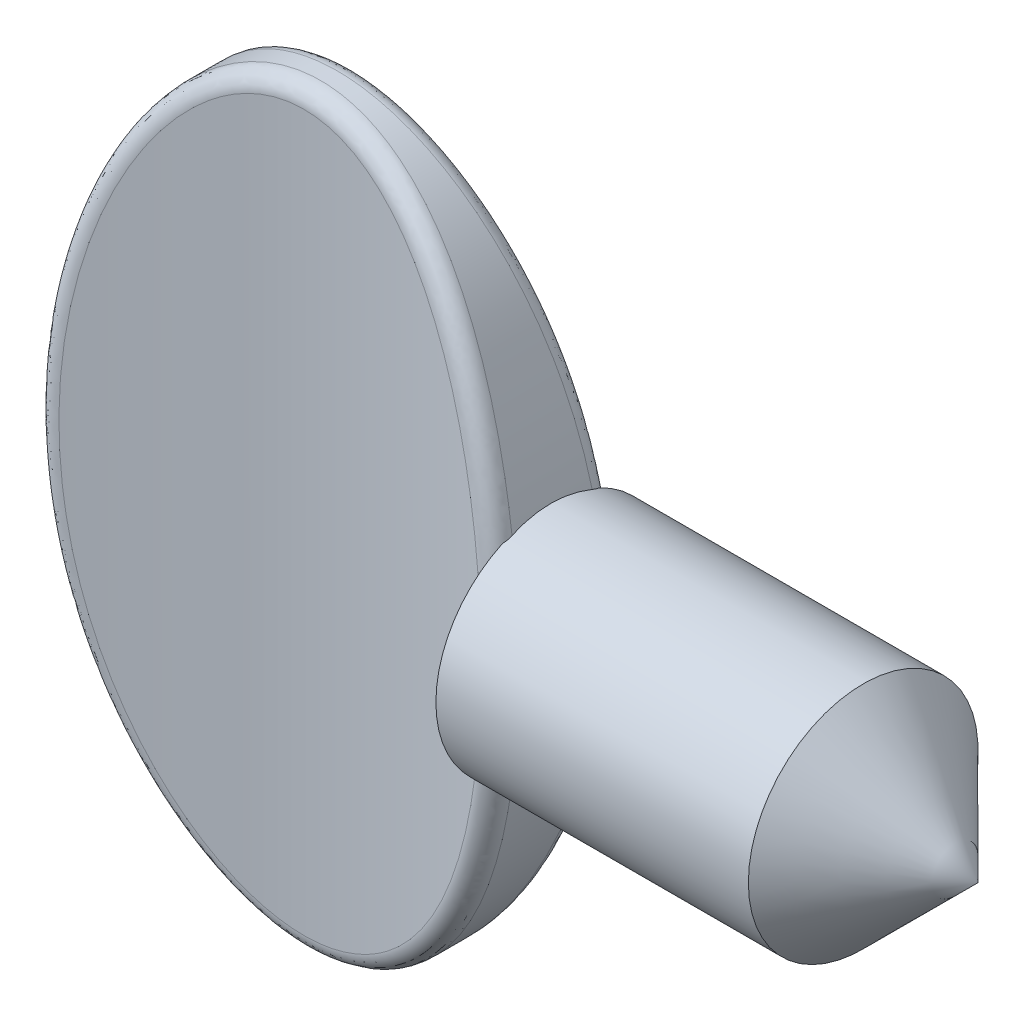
ISO-10303-21;
HEADER;
FILE_DESCRIPTION(('STEP AP214'),'2;1');
FILE_NAME('part.step','',(''),(''),'','','');
FILE_SCHEMA(('AUTOMOTIVE_DESIGN { 1 0 10303 214 1 1 1 1 }'));
ENDSEC;
DATA;
#1=APPLICATION_CONTEXT('core data for automotive mechanical design processes');
#2=APPLICATION_PROTOCOL_DEFINITION('international standard','automotive_design',2000,#1);
#3=PRODUCT_CONTEXT('',#1,'mechanical');
#4=PRODUCT('Part','Part','',(#3));
#5=PRODUCT_RELATED_PRODUCT_CATEGORY('part','',(#4));
#6=PRODUCT_DEFINITION_FORMATION('','',#4);
#7=PRODUCT_DEFINITION_CONTEXT('part definition',#1,'design');
#8=PRODUCT_DEFINITION('design','',#6,#7);
#9=PRODUCT_DEFINITION_SHAPE('','',#8);
#10=(LENGTH_UNIT() NAMED_UNIT(*) SI_UNIT(.MILLI.,.METRE.));
#11=(NAMED_UNIT(*) PLANE_ANGLE_UNIT() SI_UNIT($,.RADIAN.));
#12=(NAMED_UNIT(*) SI_UNIT($,.STERADIAN.) SOLID_ANGLE_UNIT());
#13=UNCERTAINTY_MEASURE_WITH_UNIT(LENGTH_MEASURE(1.E-05),#10,'distance_accuracy_value','');
#14=(GEOMETRIC_REPRESENTATION_CONTEXT(3) GLOBAL_UNCERTAINTY_ASSIGNED_CONTEXT((#13)) GLOBAL_UNIT_ASSIGNED_CONTEXT((#10,
#11,#12)) REPRESENTATION_CONTEXT('',''));
#15=CARTESIAN_POINT('',(0.,0.,0.));
#16=DIRECTION('',(0.,0.,1.));
#17=DIRECTION('',(1.,0.,0.));
#18=AXIS2_PLACEMENT_3D('',#15,#16,#17);
#19=CARTESIAN_POINT('',(0.,0.,1.016));
#20=DIRECTION('',(0.,0.,1.));
#21=DIRECTION('',(0.,-1.,0.));
#22=AXIS2_PLACEMENT_3D('',#19,#20,#21);
#23=ELLIPSE('',#22,5.715,3.556);
#24=DIRECTION('',(0.,0.,-1.));
#25=VECTOR('',#24,1.);
#26=SURFACE_OF_LINEAR_EXTRUSION('',#23,#25);
#27=CARTESIAN_POINT('',(3.41011531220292,-1.62014791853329,0.668376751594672));
#28=CARTESIAN_POINT('',(3.40671804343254,-1.63860905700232,0.623625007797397));
#29=CARTESIAN_POINT('',(3.40360222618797,-1.65521497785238,0.578110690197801));
#30=CARTESIAN_POINT('',(3.39801345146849,-1.68461510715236,0.485826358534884));
#31=CARTESIAN_POINT('',(3.39554052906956,-1.69740910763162,0.439056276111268));
#32=CARTESIAN_POINT('',(3.38920906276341,-1.72990576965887,0.297329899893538));
#33=CARTESIAN_POINT('',(3.38643361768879,-1.74374513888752,0.200903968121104));
#34=CARTESIAN_POINT('',(3.38412486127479,-1.75528275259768,0.00701645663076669));
#35=CARTESIAN_POINT('',(3.38459484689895,-1.75296458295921,-0.0904460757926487));
#36=CARTESIAN_POINT('',(3.38872446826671,-1.73223483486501,-0.283468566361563));
#37=CARTESIAN_POINT('',(3.39237835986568,-1.71385223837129,-0.379031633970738));
#38=CARTESIAN_POINT('',(3.39927526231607,-1.67798412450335,-0.507252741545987));
#39=CARTESIAN_POINT('',(3.40135032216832,-1.66710508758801,-0.541931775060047));
#40=CARTESIAN_POINT('',(3.40584397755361,-1.64323850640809,-0.610479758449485));
#41=CARTESIAN_POINT('',(3.4082620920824,-1.6302539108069,-0.64434976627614));
#42=CARTESIAN_POINT('',(3.41083461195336,-1.61623226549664,-0.677790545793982));
#43=B_SPLINE_CURVE_WITH_KNOTS('',3,(#27,#28,#29,#30,#31,#32,#33,#34,#35,#36,#37,#38,#39,#40,#41,
#42),.UNSPECIFIED.,.F.,.F.,(4,2,2,2,2,2,2,4),(0.,0.145499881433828,0.29100769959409,
0.581851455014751,0.872990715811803,1.16360581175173,1.2727648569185,1.381772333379),.UNSPECIFIED.);
#44=CARTESIAN_POINT('',(3.40596285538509,-1.64255427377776,0.611246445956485));
#45=VERTEX_POINT('',#44);
#46=CARTESIAN_POINT('',(3.40596285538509,-1.64255427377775,-0.611246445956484));
#47=VERTEX_POINT('',#46);
#48=EDGE_CURVE('E229',#45,#47,#43,.T.);
#49=ORIENTED_EDGE('',*,*,#48,.F.);
#50=CARTESIAN_POINT('',(2.87687361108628,2.44813994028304,0.791992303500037));
#51=CARTESIAN_POINT('',(3.18255529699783,2.5496565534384,0.881151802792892));
#52=CARTESIAN_POINT('',(3.19087427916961,2.52247577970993,0.548152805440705));
#53=CARTESIAN_POINT('',(2.94045219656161,2.23528015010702,0.810534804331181));
#54=CARTESIAN_POINT('',(3.25173180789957,2.32661822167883,0.903476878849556));
#55=CARTESIAN_POINT('',(3.25828081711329,2.30224582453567,0.567153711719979));
#56=CARTESIAN_POINT('',(2.99465455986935,2.0192696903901,0.826995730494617));
#57=CARTESIAN_POINT('',(3.31014106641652,2.10195664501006,0.923109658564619));
#58=CARTESIAN_POINT('',(3.31562682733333,2.07916028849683,0.584021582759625));
#59=CARTESIAN_POINT('',(3.08550522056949,1.5830552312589,0.855139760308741));
#60=CARTESIAN_POINT('',(3.40834569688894,1.6476446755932,0.956769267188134));
#61=CARTESIAN_POINT('',(3.41165763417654,1.6291935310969,0.612861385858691));
#62=CARTESIAN_POINT('',(3.12214641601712,1.36284957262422,0.866820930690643));
#63=CARTESIAN_POINT('',(3.44781755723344,1.41867397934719,0.970692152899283));
#64=CARTESIAN_POINT('',(3.45033488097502,1.40231081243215,0.624831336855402));
#65=CARTESIAN_POINT('',(3.17863710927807,0.919742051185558,0.885019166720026));
#66=CARTESIAN_POINT('',(3.50886358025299,0.957217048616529,0.992448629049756));
#67=CARTESIAN_POINT('',(3.50993638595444,0.946080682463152,0.643479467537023));
#68=CARTESIAN_POINT('',(3.19846897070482,0.696837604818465,0.891530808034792));
#69=CARTESIAN_POINT('',(3.53022382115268,0.725447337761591,1.00020785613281));
#70=CARTESIAN_POINT('',(3.53084199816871,0.716730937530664,0.650152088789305));
#71=CARTESIAN_POINT('',(3.22166889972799,0.250038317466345,0.89916161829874));
#72=CARTESIAN_POINT('',(3.55529121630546,0.260137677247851,1.00932947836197));
#73=CARTESIAN_POINT('',(3.55529615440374,0.257136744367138,0.657971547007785));
#74=CARTESIAN_POINT('',(3.22503654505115,0.0261434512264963,0.900280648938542));
#75=CARTESIAN_POINT('',(3.5589182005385,0.0273359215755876,1.01066276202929));
#76=CARTESIAN_POINT('',(3.55884425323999,0.0268922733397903,0.65911824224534));
#77=CARTESIAN_POINT('',(3.21529651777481,-0.424794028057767,0.897065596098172));
#78=CARTESIAN_POINT('',(3.54839475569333,-0.442282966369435,1.00681981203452));
#79=CARTESIAN_POINT('',(3.54857931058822,-0.436885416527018,0.655823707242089));
#80=CARTESIAN_POINT('',(3.20192627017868,-0.651830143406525,0.892644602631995));
#81=CARTESIAN_POINT('',(3.53399566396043,-0.67833751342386,1.00155250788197));
#82=CARTESIAN_POINT('',(3.53448957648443,-0.67041277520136,0.651293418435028));
#83=CARTESIAN_POINT('',(3.15798579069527,-1.10403389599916,0.878342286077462));
#84=CARTESIAN_POINT('',(3.48651511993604,-1.14926850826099,0.984454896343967));
#85=CARTESIAN_POINT('',(3.48815150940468,-1.13578713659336,0.636637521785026));
#86=CARTESIAN_POINT('',(3.12741141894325,-1.32920107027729,0.868459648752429));
#87=CARTESIAN_POINT('',(3.45358537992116,-1.38338047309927,0.972678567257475));
#88=CARTESIAN_POINT('',(3.45589880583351,-1.36763372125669,0.626510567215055));
#89=CARTESIAN_POINT('',(3.04849516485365,-1.77551295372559,0.843590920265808));
#90=CARTESIAN_POINT('',(3.36829281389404,-1.84818795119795,0.942941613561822));
#91=CARTESIAN_POINT('',(3.37255097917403,-1.82763853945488,0.60102703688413));
#92=CARTESIAN_POINT('',(3.00018846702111,-1.99666472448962,0.828614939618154));
#93=CARTESIAN_POINT('',(3.3162505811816,-2.07815631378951,0.925087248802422));
#94=CARTESIAN_POINT('',(3.32149316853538,-2.05580314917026,0.585680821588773));
#95=CARTESIAN_POINT('',(2.88476113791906,-2.43326023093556,0.79411239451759));
#96=CARTESIAN_POINT('',(3.19142384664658,-2.53294503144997,0.883801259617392));
#97=CARTESIAN_POINT('',(3.1992693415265,-2.50695447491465,0.550325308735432));
#98=CARTESIAN_POINT('',(2.81765268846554,-2.64870756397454,0.774588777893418));
#99=CARTESIAN_POINT('',(3.11906951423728,-2.75709243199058,0.860497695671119));
#100=CARTESIAN_POINT('',(3.12811634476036,-2.72994444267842,0.530319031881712));
#101=CARTESIAN_POINT('',(2.65311433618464,-3.0985151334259,0.729048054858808));
#102=CARTESIAN_POINT('',(2.94108253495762,-3.22556424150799,0.805967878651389));
#103=CARTESIAN_POINT('',(2.95319352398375,-3.19660978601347,0.483652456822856));
#104=CARTESIAN_POINT('',(2.55290441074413,-3.33177078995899,0.702519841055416));
#105=CARTESIAN_POINT('',(2.8329712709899,-3.46846636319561,0.77425014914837));
#106=CARTESIAN_POINT('',(2.84641629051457,-3.43928390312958,0.456468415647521));
#107=CARTESIAN_POINT('',(2.32320903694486,-3.78234312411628,0.64640489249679));
#108=CARTESIAN_POINT('',(2.58357223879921,-3.93908503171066,0.706749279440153));
#109=CARTESIAN_POINT('',(2.60051045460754,-3.91004049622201,0.398966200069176));
#110=CARTESIAN_POINT('',(2.19375678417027,-3.99967750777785,0.616821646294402));
#111=CARTESIAN_POINT('',(2.44340804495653,-4.16619911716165,0.67117436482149));
#112=CARTESIAN_POINT('',(2.46141853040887,-4.13813914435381,0.368651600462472));
#113=CARTESIAN_POINT('',(1.94091533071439,-4.3535976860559,0.565411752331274));
#114=CARTESIAN_POINT('',(2.16660546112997,-4.538377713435,0.608745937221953));
#115=CARTESIAN_POINT('',(2.18768136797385,-4.51205711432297,0.315970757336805));
#116=CARTESIAN_POINT('',(1.82542698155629,-4.49608375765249,0.543660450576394));
#117=CARTESIAN_POINT('',(2.04053515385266,-4.68812354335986,0.582339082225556));
#118=CARTESIAN_POINT('',(2.06208689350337,-4.66339853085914,0.29368172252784));
#119=CARTESIAN_POINT('',(1.57466794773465,-4.76186582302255,0.501591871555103));
#120=CARTESIAN_POINT('',(1.76506012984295,-4.96825132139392,0.530990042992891));
#121=CARTESIAN_POINT('',(1.78731476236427,-4.94761823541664,0.250573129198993));
#122=CARTESIAN_POINT('',(1.43943196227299,-4.88519470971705,0.481272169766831));
#123=CARTESIAN_POINT('',(1.6161949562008,-5.09885836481,0.506044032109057));
#124=CARTESIAN_POINT('',(1.63817843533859,-5.080528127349,0.229751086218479));
#125=CARTESIAN_POINT('',(1.19119720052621,-5.07171066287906,0.449763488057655));
#126=CARTESIAN_POINT('',(1.3404297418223,-5.29730303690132,0.467084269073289));
#127=CARTESIAN_POINT('',(1.36169787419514,-5.28324603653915,0.197463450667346));
#128=CARTESIAN_POINT('',(1.08336860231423,-5.14191532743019,0.437647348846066));
#129=CARTESIAN_POINT('',(1.22051144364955,-5.37222170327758,0.452038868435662));
#130=CARTESIAN_POINT('',(1.24085897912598,-5.36011289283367,0.185047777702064));
#131=CARTESIAN_POINT('',(0.858050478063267,-5.26424468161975,0.416270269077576));
#132=CARTESIAN_POINT('',(0.968834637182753,-5.50292549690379,0.425421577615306));
#133=CARTESIAN_POINT('',(0.986440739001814,-5.49490642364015,0.163142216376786));
#134=CARTESIAN_POINT('',(0.740575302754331,-5.31639564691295,0.407005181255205));
#135=CARTESIAN_POINT('',(0.836995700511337,-5.55903773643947,0.413787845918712));
#136=CARTESIAN_POINT('',(0.852880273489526,-5.55286061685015,0.153648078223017));
#137=CARTESIAN_POINT('',(0.515993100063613,-5.39221579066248,0.393443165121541));
#138=CARTESIAN_POINT('',(0.58410467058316,-5.64060692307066,0.396743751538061));
#139=CARTESIAN_POINT('',(0.595858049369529,-5.6375336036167,0.139750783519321));
#140=CARTESIAN_POINT('',(0.409913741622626,-5.41895204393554,0.388614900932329));
#141=CARTESIAN_POINT('',(0.464186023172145,-5.66954672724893,0.390631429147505));
#142=CARTESIAN_POINT('',(0.473813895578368,-5.66759942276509,0.134803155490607));
#143=CARTESIAN_POINT('',(0.194791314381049,-5.45394261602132,0.382284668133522));
#144=CARTESIAN_POINT('',(0.220889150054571,-5.70732589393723,0.382635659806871));
#145=CARTESIAN_POINT('',(0.22551311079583,-5.70700859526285,0.128316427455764));
#146=CARTESIAN_POINT('',(0.0857502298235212,-5.46220901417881,0.380780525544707));
#147=CARTESIAN_POINT('',(0.0971189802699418,-5.7163068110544,0.38072235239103));
#148=CARTESIAN_POINT('',(0.0992592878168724,-5.71636549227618,0.126775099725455));
#149=CARTESIAN_POINT('',(-0.132181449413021,-5.45950203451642,0.381271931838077));
#150=CARTESIAN_POINT('',(-0.149751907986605,-5.7133803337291,0.381344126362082));
#151=CARTESIAN_POINT('',(-0.153008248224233,-5.71330808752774,0.127278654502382));
#152=CARTESIAN_POINT('',(-0.24107184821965,-5.44851292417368,0.383270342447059));
#153=CARTESIAN_POINT('',(-0.273308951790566,-5.70144504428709,0.383885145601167));
#154=CARTESIAN_POINT('',(-0.279021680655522,-5.70087598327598,0.129326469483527));
#155=CARTESIAN_POINT('',(-0.455477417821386,-5.40829096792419,0.39053874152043));
#156=CARTESIAN_POINT('',(-0.515669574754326,-5.65803605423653,0.393060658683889));
#157=CARTESIAN_POINT('',(-0.526267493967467,-5.65561592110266,0.136774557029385));
#158=CARTESIAN_POINT('',(-0.560990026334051,-5.37904460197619,0.395811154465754));
#159=CARTESIAN_POINT('',(-0.634846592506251,-5.6264036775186,0.399728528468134));
#160=CARTESIAN_POINT('',(-0.647496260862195,-5.62277284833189,0.142177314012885));
#161=CARTESIAN_POINT('',(-0.791362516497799,-5.29549090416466,0.410722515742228));
#162=CARTESIAN_POINT('',(-0.894095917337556,-5.53655861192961,0.418454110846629));
#163=CARTESIAN_POINT('',(-0.910741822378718,-5.52960626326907,0.157457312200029));
#164=CARTESIAN_POINT('',(-0.914651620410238,-5.2368066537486,0.421113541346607));
#165=CARTESIAN_POINT('',(-1.03227791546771,-5.47347252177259,0.431484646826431));
#166=CARTESIAN_POINT('',(-1.05060182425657,-5.46452941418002,0.168105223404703));
#167=CARTESIAN_POINT('',(-1.15014100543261,-5.1000145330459,0.444888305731));
#168=CARTESIAN_POINT('',(-1.29493907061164,-5.32749236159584,0.461037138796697));
#169=CARTESIAN_POINT('',(-1.31582055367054,-5.31418719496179,0.192467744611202));
#170=CARTESIAN_POINT('',(-1.26232097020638,-5.02187196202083,0.45827738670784));
#171=CARTESIAN_POINT('',(-1.41945940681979,-5.24422211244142,0.477628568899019));
#172=CARTESIAN_POINT('',(-1.44115278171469,-5.22888577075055,0.20618782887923));
#173=CARTESIAN_POINT('',(-1.5242535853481,-4.81141848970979,0.493480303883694));
#174=CARTESIAN_POINT('',(-1.71006807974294,-5.02053132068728,0.521084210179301));
#175=CARTESIAN_POINT('',(-1.73197783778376,-5.00086686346,0.242261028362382));
#176=CARTESIAN_POINT('',(-1.66743267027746,-4.67075761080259,0.516329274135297));
#177=CARTESIAN_POINT('',(-1.86727379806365,-4.87182691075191,0.549058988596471));
#178=CARTESIAN_POINT('',(-1.88928718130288,-4.84982635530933,0.265674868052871));
#179=CARTESIAN_POINT('',(-1.93076565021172,-4.36861808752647,0.563157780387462));
#180=CARTESIAN_POINT('',(-2.15601250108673,-4.5538689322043,0.606083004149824));
#181=CARTESIAN_POINT('',(-2.17678970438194,-4.52789876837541,0.313661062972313));
#182=CARTESIAN_POINT('',(-2.05086652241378,-4.20709289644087,0.587139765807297));
#183=CARTESIAN_POINT('',(-2.28680032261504,-4.38442619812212,0.635112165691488));
#184=CARTESIAN_POINT('',(-2.30692049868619,-4.35696740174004,0.338235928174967));
#185=CARTESIAN_POINT('',(-2.24774440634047,-3.90468381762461,0.629494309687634));
#186=CARTESIAN_POINT('',(-2.50094051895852,-4.0683012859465,0.686196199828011));
#187=CARTESIAN_POINT('',(-2.51931723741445,-4.03858337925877,0.38163755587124));
#188=CARTESIAN_POINT('',(-2.32835126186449,-3.7663893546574,0.648005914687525));
#189=CARTESIAN_POINT('',(-2.58844569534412,-3.92375543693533,0.708482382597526));
#190=CARTESIAN_POINT('',(-2.60592272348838,-3.89353451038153,0.400606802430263));
#191=CARTESIAN_POINT('',(-2.47764655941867,-3.48301662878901,0.683921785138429));
#192=CARTESIAN_POINT('',(-2.75059891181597,-3.62773016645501,0.751698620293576));
#193=CARTESIAN_POINT('',(-2.76590357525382,-3.59720408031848,0.437410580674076));
#194=CARTESIAN_POINT('',(-2.54632812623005,-3.33793451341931,0.701325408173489));
#195=CARTESIAN_POINT('',(-2.82495665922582,-3.47639034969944,0.772577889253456));
#196=CARTESIAN_POINT('',(-2.83927131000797,-3.44591898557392,0.455244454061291));
#197=CARTESIAN_POINT('',(-2.73596214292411,-2.89487609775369,0.751105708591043));
#198=CARTESIAN_POINT('',(-3.03164049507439,-3.01174573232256,0.832642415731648));
#199=CARTESIAN_POINT('',(-3.04146428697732,-2.98492820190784,0.506255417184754));
#200=CARTESIAN_POINT('',(-2.84046694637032,-2.58914736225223,0.781043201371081));
#201=CARTESIAN_POINT('',(-3.1439027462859,-2.69404108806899,0.868280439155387));
#202=CARTESIAN_POINT('',(-3.15233965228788,-2.66814963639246,0.53693302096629));
#203=CARTESIAN_POINT('',(-3.02361670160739,-1.91917408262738,0.835455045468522));
#204=CARTESIAN_POINT('',(-3.34221273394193,-1.99525212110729,0.933484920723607));
#205=CARTESIAN_POINT('',(-3.34632626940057,-1.9756230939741,0.592690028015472));
#206=CARTESIAN_POINT('',(-3.09598835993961,-1.55305613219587,0.858425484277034));
#207=CARTESIAN_POINT('',(-3.41971506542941,-1.61558535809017,0.960711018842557));
#208=CARTESIAN_POINT('',(-3.42273238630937,-1.59818444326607,0.6162283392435));
#209=CARTESIAN_POINT('',(-3.19389380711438,-0.813438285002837,0.889906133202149));
#210=CARTESIAN_POINT('',(-3.52551559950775,-0.845326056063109,0.998352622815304));
#211=CARTESIAN_POINT('',(-3.52603668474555,-0.836598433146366,0.648487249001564));
#212=CARTESIAN_POINT('',(-3.21939459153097,-0.439933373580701,0.89840615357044));
#213=CARTESIAN_POINT('',(-3.55284253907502,-0.458062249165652,1.00842962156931));
#214=CARTESIAN_POINT('',(-3.55289998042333,-0.452446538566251,0.657197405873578));
#215=CARTESIAN_POINT('',(-3.22377462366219,0.165515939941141,0.89987188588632));
#216=CARTESIAN_POINT('',(-3.55753925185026,0.172415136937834,1.01016840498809));
#217=CARTESIAN_POINT('',(-3.55751322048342,0.170223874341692,0.658699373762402));
#218=CARTESIAN_POINT('',(-3.21666132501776,0.397456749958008,0.897504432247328));
#219=CARTESIAN_POINT('',(-3.54988979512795,0.413553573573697,1.00735185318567));
#220=CARTESIAN_POINT('',(-3.55001934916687,0.408752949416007,0.656273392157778));
#221=CARTESIAN_POINT('',(-3.18467556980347,0.860036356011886,0.887014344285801));
#222=CARTESIAN_POINT('',(-3.51533559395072,0.895293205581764,0.994814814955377));
#223=CARTESIAN_POINT('',(-3.51629985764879,0.884649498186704,0.645523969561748));
#224=CARTESIAN_POINT('',(-3.15979714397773,1.09067468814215,0.878889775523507));
#225=CARTESIAN_POINT('',(-3.4885425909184,1.13507534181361,0.985134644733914));
#226=CARTESIAN_POINT('',(-3.49006794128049,1.12201655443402,0.637198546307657));
#227=CARTESIAN_POINT('',(-3.09177046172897,1.54865418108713,0.857163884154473));
#228=CARTESIAN_POINT('',(-3.41502593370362,1.61202494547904,0.959158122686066));
#229=CARTESIAN_POINT('',(-3.41826670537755,1.59374884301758,0.614935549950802));
#230=CARTESIAN_POINT('',(-3.04863796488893,1.77599801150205,0.843567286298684));
#231=CARTESIAN_POINT('',(-3.36857207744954,1.84840189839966,0.942954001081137));
#232=CARTESIAN_POINT('',(-3.37271406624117,1.82811648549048,0.601002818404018));
#233=CARTESIAN_POINT('',(-2.94317111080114,2.22543485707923,0.81141809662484));
#234=CARTESIAN_POINT('',(-3.25454291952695,2.31651004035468,0.904496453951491));
#235=CARTESIAN_POINT('',(-3.26114490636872,2.29208476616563,0.568058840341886));
#236=CARTESIAN_POINT('',(-2.88084877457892,2.44753106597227,0.792868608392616));
#237=CARTESIAN_POINT('',(-3.18737593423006,2.5475035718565,0.882369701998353));
#238=CARTESIAN_POINT('',(-3.19514119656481,2.52168829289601,0.549050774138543));
#239=CARTESIAN_POINT('',(-2.72296807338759,2.92171701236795,0.747996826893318));
#240=CARTESIAN_POINT('',(-3.01671846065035,3.04112688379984,0.828682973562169));
#241=CARTESIAN_POINT('',(-3.02753524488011,3.01295829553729,0.503069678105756));
#242=CARTESIAN_POINT('',(-2.62354531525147,3.17242818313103,0.720887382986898));
#243=CARTESIAN_POINT('',(-2.90958371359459,3.30205054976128,0.796309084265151));
#244=CARTESIAN_POINT('',(-2.92177195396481,3.27338041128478,0.475290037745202));
#245=CARTESIAN_POINT('',(-2.45047373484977,3.53592668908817,0.677330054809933));
#246=CARTESIAN_POINT('',(-2.72089131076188,3.68328686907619,0.743720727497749));
#247=CARTESIAN_POINT('',(-2.73679732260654,3.65249750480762,0.430655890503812));
#248=CARTESIAN_POINT('',(-2.38881716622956,3.6549621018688,0.662334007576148));
#249=CARTESIAN_POINT('',(-2.65403373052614,3.80757139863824,0.725698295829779));
#250=CARTESIAN_POINT('',(-2.67077613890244,3.77691258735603,0.41528911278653));
#251=CARTESIAN_POINT('',(-2.25689122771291,3.88780573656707,0.631713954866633));
#252=CARTESIAN_POINT('',(-2.51060863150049,4.05097871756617,0.688809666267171));
#253=CARTESIAN_POINT('',(-2.52910566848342,4.02092289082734,0.383912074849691));
#254=CARTESIAN_POINT('',(-2.1866245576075,4.00161558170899,0.6160901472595));
#255=CARTESIAN_POINT('',(-2.43421779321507,4.1700328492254,0.669971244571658));
#256=CARTESIAN_POINT('',(-2.45345939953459,4.14051960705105,0.367902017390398));
#257=CARTESIAN_POINT('',(-2.00630311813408,4.26762511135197,0.57821491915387));
#258=CARTESIAN_POINT('',(-2.23805461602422,4.44810307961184,0.624273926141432));
#259=CARTESIAN_POINT('',(-2.25863520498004,4.42099703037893,0.329090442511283));
#260=CARTESIAN_POINT('',(-1.89168515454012,4.4166251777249,0.555850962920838));
#261=CARTESIAN_POINT('',(-2.11309442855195,4.6045146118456,0.597170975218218));
#262=CARTESIAN_POINT('',(-2.13426125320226,4.57889839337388,0.306173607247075));
#263=CARTESIAN_POINT('',(-1.64204982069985,4.69578543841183,0.512276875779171));
#264=CARTESIAN_POINT('',(-1.83921681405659,4.89842163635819,0.544072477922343));
#265=CARTESIAN_POINT('',(-1.86139526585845,4.87668575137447,0.261522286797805));
#266=CARTESIAN_POINT('',(-1.50706569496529,4.82597567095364,0.491064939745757));
#267=CARTESIAN_POINT('',(-1.69088789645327,5.03609559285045,0.5180866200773));
#268=CARTESIAN_POINT('',(-1.71294250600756,5.01660042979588,0.239785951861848));
#269=CARTESIAN_POINT('',(-1.25822257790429,5.02460380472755,0.457805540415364));
#270=CARTESIAN_POINT('',(-1.41485811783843,5.24717231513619,0.47703595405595));
#271=CARTESIAN_POINT('',(-1.43656618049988,5.23187493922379,0.205704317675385));
#272=CARTESIAN_POINT('',(-1.14977220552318,5.09995591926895,0.444894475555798));
#273=CARTESIAN_POINT('',(-1.29446557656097,5.32746078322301,0.461038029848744));
#274=CARTESIAN_POINT('',(-1.31538358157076,5.31413478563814,0.192474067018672));
#275=CARTESIAN_POINT('',(-0.922470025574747,5.23252776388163,0.421861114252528));
#276=CARTESIAN_POINT('',(-1.040964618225,5.46892516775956,0.432410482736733));
#277=CARTESIAN_POINT('',(-1.05942783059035,5.45981518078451,0.16887127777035));
#278=CARTESIAN_POINT('',(-0.80363402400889,5.28977445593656,0.411734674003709));
#279=CARTESIAN_POINT('',(-0.907817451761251,5.53043531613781,0.419719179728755));
#280=CARTESIAN_POINT('',(-0.92467528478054,5.52326373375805,0.158494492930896));
#281=CARTESIAN_POINT('',(-0.577455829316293,5.37398354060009,0.39672020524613));
#282=CARTESIAN_POINT('',(-0.653408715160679,5.62094693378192,0.400873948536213));
#283=CARTESIAN_POINT('',(-0.666376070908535,5.61710585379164,0.143108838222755));
#284=CARTESIAN_POINT('',(-0.471370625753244,5.4043497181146,0.391249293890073));
#285=CARTESIAN_POINT('',(-0.533622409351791,5.65378212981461,0.393957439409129));
#286=CARTESIAN_POINT('',(-0.544550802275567,5.65118930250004,0.13750267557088));
#287=CARTESIAN_POINT('',(-0.255633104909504,5.44661210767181,0.383615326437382));
#288=CARTESIAN_POINT('',(-0.289803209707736,5.69938537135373,0.384322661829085));
#289=CARTESIAN_POINT('',(-0.295851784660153,5.69872932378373,0.129679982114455));
#290=CARTESIAN_POINT('',(-0.145983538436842,5.45852223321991,0.38144977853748));
#291=CARTESIAN_POINT('',(-0.165395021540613,5.71232072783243,0.381569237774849));
#292=CARTESIAN_POINT('',(-0.168981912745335,5.71220143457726,0.127460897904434));
#293=CARTESIAN_POINT('',(0.0738869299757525,5.46278107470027,0.38067670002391));
#294=CARTESIAN_POINT('',(0.0836678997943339,5.71692492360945,0.380591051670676));
#295=CARTESIAN_POINT('',(0.0855232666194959,5.71701154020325,0.126668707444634));
#296=CARTESIAN_POINT('',(0.184108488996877,5.45509623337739,0.382075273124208));
#297=CARTESIAN_POINT('',(0.208792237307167,5.70857455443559,0.382370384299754));
#298=CARTESIAN_POINT('',(0.213159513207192,5.70831156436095,0.128101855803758));
#299=CARTESIAN_POINT('',(0.401619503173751,5.42083768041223,0.38827437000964));
#300=CARTESIAN_POINT('',(0.454815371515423,5.67158273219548,0.390201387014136));
#301=CARTESIAN_POINT('',(0.464261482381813,5.6697201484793,0.134454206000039));
#302=CARTESIAN_POINT('',(0.50890688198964,5.3942509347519,0.393077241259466));
#303=CARTESIAN_POINT('',(0.576122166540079,5.64279808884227,0.396283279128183));
#304=CARTESIAN_POINT('',(0.587724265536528,5.6398140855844,0.13937581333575));
#305=CARTESIAN_POINT('',(0.739415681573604,5.31719606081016,0.406864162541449));
#306=CARTESIAN_POINT('',(0.835739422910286,5.55988553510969,0.413613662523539));
#307=CARTESIAN_POINT('',(0.851580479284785,5.55374603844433,0.153503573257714));
#308=CARTESIAN_POINT('',(0.861383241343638,5.26294420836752,0.416504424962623));
#309=CARTESIAN_POINT('',(0.972626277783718,5.50149772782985,0.425721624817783));
#310=CARTESIAN_POINT('',(0.990242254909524,5.49345262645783,0.163382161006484));
#311=CARTESIAN_POINT('',(1.0949077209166,5.13510542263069,0.438830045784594));
#312=CARTESIAN_POINT('',(1.23342883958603,5.36492676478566,0.453514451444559));
#313=CARTESIAN_POINT('',(1.25384684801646,5.35263149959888,0.186259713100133));
#314=CARTESIAN_POINT('',(1.20644657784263,5.06148575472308,0.451520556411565));
#315=CARTESIAN_POINT('',(1.35742533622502,5.28637625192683,0.469268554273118));
#316=CARTESIAN_POINT('',(1.37876592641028,5.27206953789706,0.199263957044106));
#317=CARTESIAN_POINT('',(1.46573802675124,4.86335533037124,0.484912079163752));
#318=CARTESIAN_POINT('',(1.64542638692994,5.07559446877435,0.51054553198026));
#319=CARTESIAN_POINT('',(1.66733639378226,5.05689690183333,0.23348098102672));
#320=CARTESIAN_POINT('',(1.60745261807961,4.7307918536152,0.506661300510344));
#321=CARTESIAN_POINT('',(1.80127145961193,4.93527393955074,0.537224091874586));
#322=CARTESIAN_POINT('',(1.82341116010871,4.91420625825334,0.25576788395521));
#323=CARTESIAN_POINT('',(1.86900175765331,4.44495554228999,0.551550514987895));
#324=CARTESIAN_POINT('',(2.08839377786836,4.63419132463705,0.591965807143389));
#325=CARTESIAN_POINT('',(2.1096020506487,4.60897313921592,0.301766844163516));
#326=CARTESIAN_POINT('',(1.98878809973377,4.29163833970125,0.574693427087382));
#327=CARTESIAN_POINT('',(2.21900804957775,4.47319746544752,0.620024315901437));
#328=CARTESIAN_POINT('',(2.23966103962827,4.44638820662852,0.325481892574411));
#329=CARTESIAN_POINT('',(2.18584389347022,4.00402857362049,0.615817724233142));
#330=CARTESIAN_POINT('',(2.43354527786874,4.17232015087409,0.669684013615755));
#331=CARTESIAN_POINT('',(2.45265033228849,4.14301394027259,0.367622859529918));
#332=CARTESIAN_POINT('',(2.26678612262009,3.87233883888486,0.633878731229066));
#333=CARTESIAN_POINT('',(2.52149542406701,4.03457978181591,0.691453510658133));
#334=CARTESIAN_POINT('',(2.53976764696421,4.00465027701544,0.386130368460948));
#335=CARTESIAN_POINT('',(2.4172945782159,3.60212171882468,0.669113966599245));
#336=CARTESIAN_POINT('',(2.68508948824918,3.7521515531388,0.733890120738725));
#337=CARTESIAN_POINT('',(2.70131013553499,3.72162071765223,0.422236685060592));
#338=CARTESIAN_POINT('',(2.48685442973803,3.46359055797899,0.686287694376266));
#339=CARTESIAN_POINT('',(2.76046142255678,3.60757416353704,0.754513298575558));
#340=CARTESIAN_POINT('',(2.77572819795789,3.57695134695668,0.439834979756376));
#341=CARTESIAN_POINT('',(2.61551558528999,3.18118784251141,0.719268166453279));
#342=CARTESIAN_POINT('',(2.89998706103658,3.31289252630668,0.794118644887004));
#343=CARTESIAN_POINT('',(2.91309166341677,3.28272006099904,0.473630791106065));
#344=CARTESIAN_POINT('',(2.6746042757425,3.03731009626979,0.73507325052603));
#345=CARTESIAN_POINT('',(2.96389868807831,3.16294480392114,0.813050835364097));
#346=CARTESIAN_POINT('',(2.97602323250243,3.13315249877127,0.489826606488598));
#347=CARTESIAN_POINT('',(2.78296275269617,2.74552013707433,0.76492544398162));
#348=CARTESIAN_POINT('',(3.08122852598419,2.85877616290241,0.848829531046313));
#349=CARTESIAN_POINT('',(3.09125015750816,2.83035190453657,0.520416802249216));
#350=CARTESIAN_POINT('',(2.83222971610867,2.59760677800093,0.778972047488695));
#351=CARTESIAN_POINT('',(3.13445317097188,2.70474702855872,0.865627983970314));
#352=CARTESIAN_POINT('',(3.14354245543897,2.67711783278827,0.534810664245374));
#353=CARTESIAN_POINT('',(2.87687361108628,2.44813994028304,0.791992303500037));
#354=CARTESIAN_POINT('',(3.18255529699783,2.5496565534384,0.881151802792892));
#355=CARTESIAN_POINT('',(3.19087427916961,2.52247577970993,0.548152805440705));
#356=(BOUNDED_SURFACE() B_SPLINE_SURFACE(3,2,((#50,#51,#52),(#53,#54,#55),(#56,#57,#58),(#59,
#60,#61),(#62,#63,#64),(#65,#66,#67),(#68,#69,#70),(#71,#72,#73),(#74,#75,#76),(#77,#78,#79),
(#80,#81,#82),(#83,#84,#85),(#86,#87,#88),(#89,#90,#91),(#92,#93,#94),(#95,#96,#97),(#98,#99,
#100),(#101,#102,#103),(#104,#105,#106),(#107,#108,#109),(#110,#111,#112),(#113,#114,#115),
(#116,#117,#118),(#119,#120,#121),(#122,#123,#124),(#125,#126,#127),(#128,#129,#130),(#131,#132,
#133),(#134,#135,#136),(#137,#138,#139),(#140,#141,#142),(#143,#144,#145),(#146,#147,#148),
(#149,#150,#151),(#152,#153,#154),(#155,#156,#157),(#158,#159,#160),(#161,#162,#163),(#164,#165,
#166),(#167,#168,#169),(#170,#171,#172),(#173,#174,#175),(#176,#177,#178),(#179,#180,#181),
(#182,#183,#184),(#185,#186,#187),(#188,#189,#190),(#191,#192,#193),(#194,#195,#196),(#197,#198,
#199),(#200,#201,#202),(#203,#204,#205),(#206,#207,#208),(#209,#210,#211),(#212,#213,#214),
(#215,#216,#217),(#218,#219,#220),(#221,#222,#223),(#224,#225,#226),(#227,#228,#229),(#230,#231,
#232),(#233,#234,#235),(#236,#237,#238),(#239,#240,#241),(#242,#243,#244),(#245,#246,#247),
(#248,#249,#250),(#251,#252,#253),(#254,#255,#256),(#257,#258,#259),(#260,#261,#262),(#263,#264,
#265),(#266,#267,#268),(#269,#270,#271),(#272,#273,#274),(#275,#276,#277),(#278,#279,#280),
(#281,#282,#283),(#284,#285,#286),(#287,#288,#289),(#290,#291,#292),(#293,#294,#295),(#296,#297,
#298),(#299,#300,#301),(#302,#303,#304),(#305,#306,#307),(#308,#309,#310),(#311,#312,#313),
(#314,#315,#316),(#317,#318,#319),(#320,#321,#322),(#323,#324,#325),(#326,#327,#328),(#329,#330,
#331),(#332,#333,#334),(#335,#336,#337),(#338,#339,#340),(#341,#342,#343),(#344,#345,#346),
(#347,#348,#349),(#350,#351,#352),(#353,#354,#355)),.UNSPECIFIED.,.T.,.F.,
.F.) B_SPLINE_SURFACE_WITH_KNOTS((4,2,2,2,2,2,2,2,2,2,2,2,2,2,2,2,2,2,2,2,2,2,2,2,2,2,2,2,2,2,2,
2,2,2,2,2,2,2,2,2,2,2,2,2,2,2,2,2,2,2,4),(3,3),(0.,0.670088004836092,1.34044677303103,
2.01150801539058,2.68258646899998,3.36432560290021,4.04622885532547,4.72678632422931,
5.40690386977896,6.17399274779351,6.94021517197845,7.49835151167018,8.05551867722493,
8.44869733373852,8.84130132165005,9.17597761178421,9.51043495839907,9.8451656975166,
10.1801446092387,10.5969595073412,11.0145231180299,11.6249253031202,12.2367135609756,
12.7226461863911,13.2088580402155,14.1814928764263,15.3007522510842,16.4207994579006,
17.116313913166,17.8120621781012,18.5072109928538,19.2019252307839,20.0156340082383,
20.4222285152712,20.8286958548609,21.4003838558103,21.9711485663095,22.3745805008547,
22.7774087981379,23.1149751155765,23.4522868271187,23.7901765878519,24.1282995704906,
24.5358772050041,24.9441481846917,25.5345239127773,26.1261823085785,26.5957484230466,
27.0655766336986,27.5359670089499,28.0064923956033),(0.,1.),
.UNSPECIFIED.) GEOMETRIC_REPRESENTATION_ITEM() RATIONAL_B_SPLINE_SURFACE(((1.,0.605083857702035,
1.),(1.,0.60161178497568,1.),(1.,0.598611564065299,1.),(1.,0.593550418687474,1.),(1.,
0.591489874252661,1.),(1.,0.588302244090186,1.),(1.,0.587176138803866,1.),(1.,0.585858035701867,
1.),(1.,0.585666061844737,1.),(1.,0.586220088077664,1.),(1.,0.586981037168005,1.),(1.,
0.589468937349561,1.),(1.,0.591196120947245,1.),(1.,0.595617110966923,1.),(1.,0.598309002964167,
1.),(1.,0.604664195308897,1.),(1.,0.608326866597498,1.),(1.,0.617156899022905,1.),(1.,
0.622456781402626,1.),(1.,0.634262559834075,1.),(1.,0.640767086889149,1.),(1.,0.652862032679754,
1.),(1.,0.65822097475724,1.),(1.,0.66920554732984,1.),(1.,0.674830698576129,1.),(1.,
0.684105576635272,1.),(1.,0.687849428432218,1.),(1.,0.694725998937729,1.),(1.,0.697859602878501,
1.),(1.,0.70257659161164,1.),(1.,0.704320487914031,1.),(1.,0.706625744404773,1.),(1.,
0.70718787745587,1.),(1.,0.70700627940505,1.),(1.,0.706261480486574,1.),(1.,0.703627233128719,
1.),(1.,0.701736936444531,1.),(1.,0.696594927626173,1.),(1.,0.693123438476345,1.),(1.,
0.685596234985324,1.),(1.,0.681539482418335,1.),(1.,0.6714001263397,1.),(1.,0.665247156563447,
1.),(1.,0.653377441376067,1.),(1.,0.647661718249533,1.),(1.,0.638021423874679,1.),(1.,
0.633970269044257,1.),(1.,0.626341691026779,1.),(1.,0.622764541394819,1.),(1.,0.612770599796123,
1.),(1.,0.607093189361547,1.),(1.,0.597028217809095,1.),(1.,0.59296412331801,1.),(1.,
0.58744293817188,1.),(1.,0.585987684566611,1.),(1.,0.585737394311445,1.),(1.,0.586143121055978,
1.),(1.,0.587958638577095,1.),(1.,0.589368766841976,1.),(1.,0.59319654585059,1.),(1.,
0.595613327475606,1.),(1.,0.601457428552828,1.),(1.,0.604884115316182,1.),(1.,0.613433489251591,
1.),(1.,0.618746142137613,1.),(1.,0.627733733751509,1.),(1.,0.630898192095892,1.),(1.,
0.637550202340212,1.),(1.,0.64103765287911,1.),(1.,0.649782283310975,1.),(1.,0.655182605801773,
1.),(1.,0.666333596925,1.),(1.,0.672083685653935,1.),(1.,0.681684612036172,1.),(1.,
0.685598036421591,1.),(1.,0.692883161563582,1.),(1.,0.696255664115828,1.),(1.,0.701416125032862,
1.),(1.,0.703372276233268,1.),(1.,0.706134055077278,1.),(1.,0.706940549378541,1.),(1.,
0.707226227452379,1.),(1.,0.706703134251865,1.),(1.,0.70444356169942,1.),(1.,0.702706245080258,
1.),(1.,0.697906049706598,1.),(1.,0.694644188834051,1.),(1.,0.687475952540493,1.),(1.,
0.683568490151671,1.),(1.,0.673792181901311,1.),(1.,0.667825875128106,1.),(1.,0.656237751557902,
1.),(1.,0.650616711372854,1.),(1.,0.641085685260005,1.),(1.,0.637061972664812,1.),(1.,
0.62944847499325,1.),(1.,0.625858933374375,1.),(1.,0.619133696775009,1.),(1.,0.615998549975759,
1.),(1.,0.610192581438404,1.),(1.,0.60752189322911,1.),(1.,0.605083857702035,1.))) REPRESENTATION_ITEM('') SURFACE());
#357=CARTESIAN_POINT('',(3.19087427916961,2.52247577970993,0.548152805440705));
#358=CARTESIAN_POINT('',(3.25828081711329,2.30224582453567,0.567153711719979));
#359=CARTESIAN_POINT('',(3.31562682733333,2.07916028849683,0.584021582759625));
#360=CARTESIAN_POINT('',(3.41165763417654,1.6291935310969,0.612861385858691));
#361=CARTESIAN_POINT('',(3.45033488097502,1.40231081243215,0.624831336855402));
#362=CARTESIAN_POINT('',(3.50993638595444,0.946080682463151,0.643479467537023));
#363=CARTESIAN_POINT('',(3.53084199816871,0.716730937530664,0.650152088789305));
#364=CARTESIAN_POINT('',(3.55529615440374,0.257136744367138,0.657971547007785));
#365=CARTESIAN_POINT('',(3.55884425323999,0.0268922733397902,0.65911824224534));
#366=CARTESIAN_POINT('',(3.54857931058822,-0.436885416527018,0.655823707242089));
#367=CARTESIAN_POINT('',(3.53448957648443,-0.67041277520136,0.651293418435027));
#368=CARTESIAN_POINT('',(3.48815150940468,-1.13578713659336,0.636637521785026));
#369=CARTESIAN_POINT('',(3.45589880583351,-1.36763372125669,0.626510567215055));
#370=CARTESIAN_POINT('',(3.37255097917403,-1.82763853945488,0.60102703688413));
#371=CARTESIAN_POINT('',(3.32149316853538,-2.05580314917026,0.585680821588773));
#372=CARTESIAN_POINT('',(3.1992693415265,-2.50695447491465,0.550325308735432));
#373=CARTESIAN_POINT('',(3.12811634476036,-2.72994444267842,0.530319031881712));
#374=CARTESIAN_POINT('',(2.95319352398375,-3.19660978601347,0.483652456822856));
#375=CARTESIAN_POINT('',(2.84641629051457,-3.43928390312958,0.456468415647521));
#376=CARTESIAN_POINT('',(2.60051045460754,-3.91004049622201,0.398966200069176));
#377=CARTESIAN_POINT('',(2.46141853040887,-4.13813914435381,0.368651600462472));
#378=CARTESIAN_POINT('',(2.18768136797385,-4.51205711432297,0.315970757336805));
#379=CARTESIAN_POINT('',(2.06208689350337,-4.66339853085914,0.29368172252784));
#380=CARTESIAN_POINT('',(1.78731476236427,-4.94761823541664,0.250573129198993));
#381=CARTESIAN_POINT('',(1.63817843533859,-5.080528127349,0.229751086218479));
#382=CARTESIAN_POINT('',(1.36169787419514,-5.28324603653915,0.197463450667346));
#383=CARTESIAN_POINT('',(1.24085897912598,-5.36011289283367,0.185047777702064));
#384=CARTESIAN_POINT('',(0.986440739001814,-5.49490642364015,0.163142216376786));
#385=CARTESIAN_POINT('',(0.852880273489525,-5.55286061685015,0.153648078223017));
#386=CARTESIAN_POINT('',(0.595858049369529,-5.6375336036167,0.139750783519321));
#387=CARTESIAN_POINT('',(0.473813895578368,-5.66759942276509,0.134803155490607));
#388=CARTESIAN_POINT('',(0.22551311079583,-5.70700859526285,0.128316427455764));
#389=CARTESIAN_POINT('',(0.0992592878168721,-5.71636549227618,0.126775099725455));
#390=CARTESIAN_POINT('',(-0.153008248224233,-5.71330808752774,0.127278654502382));
#391=CARTESIAN_POINT('',(-0.279021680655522,-5.70087598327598,0.129326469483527));
#392=CARTESIAN_POINT('',(-0.526267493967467,-5.65561592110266,0.136774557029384));
#393=CARTESIAN_POINT('',(-0.647496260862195,-5.62277284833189,0.142177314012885));
#394=CARTESIAN_POINT('',(-0.910741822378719,-5.52960626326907,0.157457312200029));
#395=CARTESIAN_POINT('',(-1.05060182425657,-5.46452941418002,0.168105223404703));
#396=CARTESIAN_POINT('',(-1.31582055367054,-5.31418719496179,0.192467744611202));
#397=CARTESIAN_POINT('',(-1.44115278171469,-5.22888577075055,0.20618782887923));
#398=CARTESIAN_POINT('',(-1.73197783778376,-5.00086686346,0.242261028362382));
#399=CARTESIAN_POINT('',(-1.88928718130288,-4.84982635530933,0.265674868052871));
#400=CARTESIAN_POINT('',(-2.17678970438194,-4.52789876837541,0.313661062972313));
#401=CARTESIAN_POINT('',(-2.30692049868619,-4.35696740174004,0.338235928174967));
#402=CARTESIAN_POINT('',(-2.51931723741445,-4.03858337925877,0.38163755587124));
#403=CARTESIAN_POINT('',(-2.60592272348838,-3.89353451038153,0.400606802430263));
#404=CARTESIAN_POINT('',(-2.76590357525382,-3.59720408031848,0.437410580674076));
#405=CARTESIAN_POINT('',(-2.83927131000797,-3.44591898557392,0.455244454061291));
#406=CARTESIAN_POINT('',(-3.04146428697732,-2.98492820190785,0.506255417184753));
#407=CARTESIAN_POINT('',(-3.15233965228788,-2.66814963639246,0.53693302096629));
#408=CARTESIAN_POINT('',(-3.34632626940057,-1.9756230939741,0.592690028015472));
#409=CARTESIAN_POINT('',(-3.42273238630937,-1.59818444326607,0.6162283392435));
#410=CARTESIAN_POINT('',(-3.52603668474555,-0.836598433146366,0.648487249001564));
#411=CARTESIAN_POINT('',(-3.55289998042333,-0.452446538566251,0.657197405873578));
#412=CARTESIAN_POINT('',(-3.55751322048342,0.170223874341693,0.658699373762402));
#413=CARTESIAN_POINT('',(-3.55001934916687,0.408752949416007,0.656273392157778));
#414=CARTESIAN_POINT('',(-3.51629985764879,0.884649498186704,0.645523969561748));
#415=CARTESIAN_POINT('',(-3.49006794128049,1.12201655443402,0.637198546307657));
#416=CARTESIAN_POINT('',(-3.41826670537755,1.59374884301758,0.614935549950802));
#417=CARTESIAN_POINT('',(-3.37271406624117,1.82811648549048,0.601002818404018));
#418=CARTESIAN_POINT('',(-3.26114490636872,2.29208476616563,0.568058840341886));
#419=CARTESIAN_POINT('',(-3.19514119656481,2.52168829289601,0.549050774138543));
#420=CARTESIAN_POINT('',(-3.02753524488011,3.01295829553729,0.503069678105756));
#421=CARTESIAN_POINT('',(-2.92177195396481,3.27338041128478,0.475290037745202));
#422=CARTESIAN_POINT('',(-2.73679732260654,3.65249750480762,0.430655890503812));
#423=CARTESIAN_POINT('',(-2.67077613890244,3.77691258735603,0.41528911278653));
#424=CARTESIAN_POINT('',(-2.52910566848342,4.02092289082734,0.383912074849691));
#425=CARTESIAN_POINT('',(-2.45345939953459,4.14051960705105,0.367902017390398));
#426=CARTESIAN_POINT('',(-2.25863520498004,4.42099703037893,0.329090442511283));
#427=CARTESIAN_POINT('',(-2.13426125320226,4.57889839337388,0.306173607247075));
#428=CARTESIAN_POINT('',(-1.86139526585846,4.87668575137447,0.261522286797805));
#429=CARTESIAN_POINT('',(-1.71294250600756,5.01660042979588,0.239785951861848));
#430=CARTESIAN_POINT('',(-1.43656618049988,5.23187493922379,0.205704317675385));
#431=CARTESIAN_POINT('',(-1.31538358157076,5.31413478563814,0.192474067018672));
#432=CARTESIAN_POINT('',(-1.05942783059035,5.45981518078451,0.16887127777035));
#433=CARTESIAN_POINT('',(-0.92467528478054,5.52326373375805,0.158494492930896));
#434=CARTESIAN_POINT('',(-0.666376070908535,5.61710585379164,0.143108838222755));
#435=CARTESIAN_POINT('',(-0.544550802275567,5.65118930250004,0.13750267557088));
#436=CARTESIAN_POINT('',(-0.295851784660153,5.69872932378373,0.129679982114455));
#437=CARTESIAN_POINT('',(-0.168981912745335,5.71220143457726,0.127460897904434));
#438=CARTESIAN_POINT('',(0.0855232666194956,5.71701154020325,0.126668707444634));
#439=CARTESIAN_POINT('',(0.213159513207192,5.70831156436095,0.128101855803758));
#440=CARTESIAN_POINT('',(0.464261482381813,5.6697201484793,0.134454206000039));
#441=CARTESIAN_POINT('',(0.587724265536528,5.6398140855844,0.13937581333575));
#442=CARTESIAN_POINT('',(0.851580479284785,5.55374603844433,0.153503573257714));
#443=CARTESIAN_POINT('',(0.990242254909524,5.49345262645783,0.163382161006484));
#444=CARTESIAN_POINT('',(1.25384684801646,5.35263149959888,0.186259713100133));
#445=CARTESIAN_POINT('',(1.37876592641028,5.27206953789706,0.199263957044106));
#446=CARTESIAN_POINT('',(1.66733639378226,5.05689690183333,0.23348098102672));
#447=CARTESIAN_POINT('',(1.82341116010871,4.91420625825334,0.25576788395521));
#448=CARTESIAN_POINT('',(2.1096020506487,4.60897313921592,0.301766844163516));
#449=CARTESIAN_POINT('',(2.23966103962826,4.44638820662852,0.325481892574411));
#450=CARTESIAN_POINT('',(2.45265033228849,4.14301394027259,0.367622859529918));
#451=CARTESIAN_POINT('',(2.53976764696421,4.00465027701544,0.386130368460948));
#452=CARTESIAN_POINT('',(2.70131013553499,3.72162071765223,0.422236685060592));
#453=CARTESIAN_POINT('',(2.77572819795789,3.57695134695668,0.439834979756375));
#454=CARTESIAN_POINT('',(2.91309166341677,3.28272006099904,0.473630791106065));
#455=CARTESIAN_POINT('',(2.97602323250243,3.13315249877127,0.489826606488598));
#456=CARTESIAN_POINT('',(3.09125015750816,2.83035190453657,0.520416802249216));
#457=CARTESIAN_POINT('',(3.14354245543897,2.67711783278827,0.534810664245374));
#458=CARTESIAN_POINT('',(3.19087427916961,2.52247577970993,0.548152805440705));
#459=B_SPLINE_CURVE_WITH_KNOTS('',3,(#357,#358,#359,#360,#361,#362,#363,#364,#365,#366,#367,
#368,#369,#370,#371,#372,#373,#374,#375,#376,#377,#378,#379,#380,#381,#382,#383,#384,#385,#386,
#387,#388,#389,#390,#391,#392,#393,#394,#395,#396,#397,#398,#399,#400,#401,#402,#403,#404,#405,
#406,#407,#408,#409,#410,#411,#412,#413,#414,#415,#416,#417,#418,#419,#420,#421,#422,#423,#424,
#425,#426,#427,#428,#429,#430,#431,#432,#433,#434,#435,#436,#437,#438,#439,#440,#441,#442,#443,
#444,#445,#446,#447,#448,#449,#450,#451,#452,#453,#454,#455,#456,#457,#458),.UNSPECIFIED.,.T.,
.F.,(4,2,2,2,2,2,2,2,2,2,2,2,2,2,2,2,2,2,2,2,2,2,2,2,2,2,2,2,2,2,2,2,2,2,2,2,2,2,2,2,2,2,2,2,2,
2,2,2,2,2,4),(0.,0.670088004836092,1.34044677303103,2.01150801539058,2.68258646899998,
3.36432560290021,4.04622885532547,4.72678632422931,5.40690386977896,6.17399274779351,
6.94021517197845,7.49835151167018,8.05551867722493,8.44869733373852,8.84130132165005,
9.17597761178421,9.51043495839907,9.8451656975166,10.1801446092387,10.5969595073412,
11.0145231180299,11.6249253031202,12.2367135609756,12.7226461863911,13.2088580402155,
14.1814928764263,15.3007522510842,16.4207994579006,17.116313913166,17.8120621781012,
18.5072109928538,19.2019252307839,20.0156340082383,20.4222285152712,20.8286958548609,
21.4003838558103,21.9711485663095,22.3745805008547,22.7774087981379,23.1149751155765,
23.4522868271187,23.7901765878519,24.1282995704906,24.5358772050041,24.9441481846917,
25.5345239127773,26.1261823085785,26.5957484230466,27.0655766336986,27.5359670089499,
28.0064923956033),.UNSPECIFIED.);
#460=CARTESIAN_POINT('',(3.40596285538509,1.64255427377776,0.611246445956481));
#461=VERTEX_POINT('',#460);
#462=EDGE_CURVE('E245',#45,#461,#459,.T.);
#463=ORIENTED_EDGE('',*,*,#462,.T.);
#464=CARTESIAN_POINT('',(3.41083461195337,1.61623226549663,-0.677790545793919));
#465=CARTESIAN_POINT('',(3.40739829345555,1.63495502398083,-0.633143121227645));
#466=CARTESIAN_POINT('',(3.40423995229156,1.65182673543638,-0.587722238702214));
#467=CARTESIAN_POINT('',(3.39856043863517,1.68176523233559,-0.495602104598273));
#468=CARTESIAN_POINT('',(3.39603930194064,1.69483180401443,-0.448902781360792));
#469=CARTESIAN_POINT('',(3.38955654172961,1.72815399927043,-0.307351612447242));
#470=CARTESIAN_POINT('',(3.38667145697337,1.74255372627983,-0.210994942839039));
#471=CARTESIAN_POINT('',(3.38413914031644,1.75521385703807,-0.0171476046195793));
#472=CARTESIAN_POINT('',(3.38449523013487,1.75345770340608,0.0803441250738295));
#473=CARTESIAN_POINT('',(3.38840701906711,1.73383459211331,0.273519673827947));
#474=CARTESIAN_POINT('',(3.3919569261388,1.71599679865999,0.369206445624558));
#475=CARTESIAN_POINT('',(3.39872396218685,1.68086475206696,0.497621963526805));
#476=CARTESIAN_POINT('',(3.40076333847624,1.67019367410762,0.532334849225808));
#477=CARTESIAN_POINT('',(3.4051885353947,1.64674169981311,0.600964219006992));
#478=CARTESIAN_POINT('',(3.40757387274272,1.63396374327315,0.634881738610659));
#479=CARTESIAN_POINT('',(3.41011531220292,1.62014791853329,0.668376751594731));
#480=B_SPLINE_CURVE_WITH_KNOTS('',3,(#464,#465,#466,#467,#468,#469,#470,#471,#472,#473,#474,
#475,#476,#477,#478,#479),.UNSPECIFIED.,.F.,.F.,(4,2,2,2,2,2,2,4),(0.,0.145520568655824,
0.291049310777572,0.581940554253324,0.873129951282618,1.16379233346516,1.27285754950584,
1.38177185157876),.UNSPECIFIED.);
#481=CARTESIAN_POINT('',(3.40596285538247,1.64255427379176,-0.611246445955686));
#482=VERTEX_POINT('',#481);
#483=EDGE_CURVE('E64',#482,#461,#480,.T.);
#484=ORIENTED_EDGE('',*,*,#483,.F.);
#485=CARTESIAN_POINT('',(-0.123092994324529,-5.45693709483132,-0.381737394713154));
#486=CARTESIAN_POINT('',(-0.13943752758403,-5.71060677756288,-0.381933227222));
#487=CARTESIAN_POINT('',(-0.142470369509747,-5.71041133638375,-0.127755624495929));
#488=CARTESIAN_POINT('',(-0.0114542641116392,-5.46430737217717,-0.380400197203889));
#489=CARTESIAN_POINT('',(-0.0130964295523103,-5.7185671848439,-0.380242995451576));
#490=CARTESIAN_POINT('',(-0.013303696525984,-5.71873172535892,-0.126385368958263));
#491=CARTESIAN_POINT('',(0.10085445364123,-5.46159545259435,-0.380894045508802));
#492=CARTESIAN_POINT('',(0.114452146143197,-5.71561905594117,-0.380871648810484));
#493=CARTESIAN_POINT('',(0.116820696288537,-5.71565965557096,-0.126891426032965));
#494=CARTESIAN_POINT('',(0.323240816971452,-5.43627548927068,-0.385482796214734));
#495=CARTESIAN_POINT('',(0.36616657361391,-5.68826377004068,-0.38667272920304));
#496=CARTESIAN_POINT('',(0.373878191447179,-5.68710200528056,-0.131593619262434));
#497=CARTESIAN_POINT('',(0.433317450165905,-5.41365861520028,-0.389579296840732));
#498=CARTESIAN_POINT('',(0.490792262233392,-5.66374469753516,-0.391868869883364));
#499=CARTESIAN_POINT('',(0.500809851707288,-5.6616064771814,-0.135791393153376));
#500=CARTESIAN_POINT('',(0.644091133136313,-5.35179132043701,-0.40068524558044));
#501=CARTESIAN_POINT('',(0.728336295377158,-5.5971472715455,-0.405840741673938));
#502=CARTESIAN_POINT('',(0.74264489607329,-5.59233995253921,-0.147171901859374));
#503=CARTESIAN_POINT('',(0.744985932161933,-5.31321078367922,-0.407577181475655));
#504=CARTESIAN_POINT('',(0.841822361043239,-5.55558459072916,-0.414511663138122));
#505=CARTESIAN_POINT('',(0.857822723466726,-5.54930591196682,-0.154234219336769));
#506=CARTESIAN_POINT('',(0.9403389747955,-5.22213621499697,-0.423651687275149));
#507=CARTESIAN_POINT('',(1.06066491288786,-5.45803154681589,-0.434596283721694));
#508=CARTESIAN_POINT('',(1.07955626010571,-5.44842640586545,-0.170706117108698));
#509=CARTESIAN_POINT('',(1.03479463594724,-5.16963664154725,-0.432835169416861));
#510=CARTESIAN_POINT('',(1.16613627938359,-5.40184295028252,-0.446048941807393));
#511=CARTESIAN_POINT('',(1.18610851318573,-5.39057504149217,-0.180116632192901));
#512=CARTESIAN_POINT('',(1.271676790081,-5.01803561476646,-0.458944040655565));
#513=CARTESIAN_POINT('',(1.43043294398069,-5.23995428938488,-0.478496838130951));
#514=CARTESIAN_POINT('',(1.45183198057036,-5.22462942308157,-0.206870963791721));
#515=CARTESIAN_POINT('',(1.40849087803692,-4.90997192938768,-0.47718876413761));
#516=CARTESIAN_POINT('',(1.58171111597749,-5.12506482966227,-0.501021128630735));
#517=CARTESIAN_POINT('',(1.60376597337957,-5.10733165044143,-0.225566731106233));
#518=CARTESIAN_POINT('',(1.66378977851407,-4.67333881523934,-0.515782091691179));
#519=CARTESIAN_POINT('',(1.86315917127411,-4.87496295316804,-0.548327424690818));
#520=CARTESIAN_POINT('',(1.88530186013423,-4.85266962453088,-0.265114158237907));
#521=CARTESIAN_POINT('',(1.78222013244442,-4.54471066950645,-0.536136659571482));
#522=CARTESIAN_POINT('',(1.99288439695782,-4.73940152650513,-0.57314523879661));
#523=CARTESIAN_POINT('',(2.01483752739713,-4.7152480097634,-0.285971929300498));
#524=CARTESIAN_POINT('',(1.97815175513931,-4.30254854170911,-0.57285030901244));
#525=CARTESIAN_POINT('',(2.20694456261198,-4.48537708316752,-0.617672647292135));
#526=CARTESIAN_POINT('',(2.22804741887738,-4.4580807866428,-0.323593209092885));
#527=CARTESIAN_POINT('',(2.05896619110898,-4.1917635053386,-0.589121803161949));
#528=CARTESIAN_POINT('',(2.29506608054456,-4.36919303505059,-0.637371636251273));
#529=CARTESIAN_POINT('',(2.31558209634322,-4.34093695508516,-0.340266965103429));
#530=CARTESIAN_POINT('',(2.21088759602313,-3.96334326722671,-0.621395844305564));
#531=CARTESIAN_POINT('',(2.46065656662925,-4.12994044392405,-0.676381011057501));
#532=CARTESIAN_POINT('',(2.47960893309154,-4.10026432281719,-0.373338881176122));
#533=CARTESIAN_POINT('',(2.28198911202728,-3.84570427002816,-0.63739823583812));
#534=CARTESIAN_POINT('',(2.53791362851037,-4.00690623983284,-0.695667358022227));
#535=CARTESIAN_POINT('',(2.55609489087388,-3.97673198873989,-0.389736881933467));
#536=CARTESIAN_POINT('',(2.48197516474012,-3.48456914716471,-0.684342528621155));
#537=CARTESIAN_POINT('',(2.75646049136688,-3.62745984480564,-0.752504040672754));
#538=CARTESIAN_POINT('',(2.7707112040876,-3.59853940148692,-0.43784172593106));
#539=CARTESIAN_POINT('',(2.59741295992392,-3.2330211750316,-0.714195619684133));
#540=CARTESIAN_POINT('',(2.88095109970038,-3.36542811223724,-0.788209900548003));
#541=CARTESIAN_POINT('',(2.89386126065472,-3.33645974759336,-0.468432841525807));
#542=CARTESIAN_POINT('',(2.77202139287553,-2.78115350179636,-0.761715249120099));
#543=CARTESIAN_POINT('',(3.06963853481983,-2.89528218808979,-0.84506466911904));
#544=CARTESIAN_POINT('',(3.07965353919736,-2.86722244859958,-0.517127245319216));
#545=CARTESIAN_POINT('',(2.83804619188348,-2.58361547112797,-0.780567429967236));
#546=CARTESIAN_POINT('',(3.14088339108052,-2.68969572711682,-0.867584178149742));
#547=CARTESIAN_POINT('',(3.14972736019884,-2.66257848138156,-0.536445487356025));
#548=CARTESIAN_POINT('',(2.95375739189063,-2.18312492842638,-0.814557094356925));
#549=CARTESIAN_POINT('',(3.26604892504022,-2.27247815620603,-0.908266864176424));
#550=CARTESIAN_POINT('',(3.27236120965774,-2.24837318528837,-0.571275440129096));
#551=CARTESIAN_POINT('',(3.00343598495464,-1.98016987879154,-0.829692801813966));
#552=CARTESIAN_POINT('',(3.31960342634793,-2.06136105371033,-0.926325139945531));
#553=CARTESIAN_POINT('',(3.32491286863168,-2.03880955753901,-0.58678533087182));
#554=CARTESIAN_POINT('',(3.0873734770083,-1.57060867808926,-0.855744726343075));
#555=CARTESIAN_POINT('',(3.41033450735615,-1.63481064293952,-0.957482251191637));
#556=CARTESIAN_POINT('',(3.41362808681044,-1.61637526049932,-0.613481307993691));
#557=CARTESIAN_POINT('',(3.12162556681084,-1.36400095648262,-0.866659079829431));
#558=CARTESIAN_POINT('',(3.44724682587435,-1.41994009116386,-0.970495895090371));
#559=CARTESIAN_POINT('',(3.4497844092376,-1.40350317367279,-0.624665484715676));
#560=CARTESIAN_POINT('',(3.17532031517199,-0.948490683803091,-0.883945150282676));
#561=CARTESIAN_POINT('',(3.50527124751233,-0.987224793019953,-0.991161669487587));
#562=CARTESIAN_POINT('',(3.5064378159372,-0.975674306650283,-0.642378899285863));
#563=CARTESIAN_POINT('',(3.19475610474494,-0.739587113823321,-0.890314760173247));
#564=CARTESIAN_POINT('',(3.52621293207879,-0.769971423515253,-0.998754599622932));
#565=CARTESIAN_POINT('',(3.52692763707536,-0.760716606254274,-0.648905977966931));
#566=CARTESIAN_POINT('',(3.2194661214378,-0.315050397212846,-0.898432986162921));
#567=CARTESIAN_POINT('',(3.55291391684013,-0.327833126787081,-1.00845949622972));
#568=CARTESIAN_POINT('',(3.55297488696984,-0.324001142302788,-0.657224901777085));
#569=CARTESIAN_POINT('',(3.22433680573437,-0.0993899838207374,-0.900049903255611));
#570=CARTESIAN_POINT('',(3.55816108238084,-0.103567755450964,-1.01038645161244));
#571=CARTESIAN_POINT('',(3.55810681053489,-0.102218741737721,-0.658881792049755));
#572=CARTESIAN_POINT('',(3.21886534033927,0.331615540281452,-0.898243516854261));
#573=CARTESIAN_POINT('',(3.55224851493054,0.345296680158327,-1.00822707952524));
#574=CARTESIAN_POINT('',(3.55234044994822,0.341049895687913,-0.657030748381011));
#575=CARTESIAN_POINT('',(3.20852926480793,0.546960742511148,-0.894822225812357));
#576=CARTESIAN_POINT('',(3.54111275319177,0.569232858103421,-1.00414952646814));
#577=CARTESIAN_POINT('',(3.54144856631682,0.562536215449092,-0.653524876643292));
#578=CARTESIAN_POINT('',(3.17246927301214,0.976127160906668,-0.883040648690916));
#579=CARTESIAN_POINT('',(3.50215056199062,1.01617613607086,-0.990065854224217));
#580=CARTESIAN_POINT('',(3.5034277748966,1.00412831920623,-0.641452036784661));
#581=CARTESIAN_POINT('',(3.14674900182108,1.18994872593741,-0.874681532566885));
#582=CARTESIAN_POINT('',(3.47444316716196,1.23852947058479,-0.980102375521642));
#583=CARTESIAN_POINT('',(3.47630271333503,1.22423441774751,-0.632886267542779));
#584=CARTESIAN_POINT('',(3.07946080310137,1.61460140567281,-0.853291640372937));
#585=CARTESIAN_POINT('',(3.40171524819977,1.68076462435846,-0.954526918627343));
#586=CARTESIAN_POINT('',(3.40526412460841,1.66173141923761,-0.610967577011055));
#587=CARTESIAN_POINT('',(3.03789740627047,1.82543335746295,-0.840262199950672));
#588=CARTESIAN_POINT('',(3.35691551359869,1.90001742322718,-0.938989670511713));
#589=CARTESIAN_POINT('',(3.36135539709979,1.87912308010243,-0.597616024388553));
#590=CARTESIAN_POINT('',(2.91311756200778,2.34720251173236,-0.802312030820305));
#591=CARTESIAN_POINT('',(3.22235162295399,2.4422490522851,-0.893698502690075));
#592=CARTESIAN_POINT('',(3.22934609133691,2.417836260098,-0.558727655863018));
#593=CARTESIAN_POINT('',(2.81946544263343,2.65548937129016,-0.77470296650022));
#594=CARTESIAN_POINT('',(3.12176418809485,2.76249199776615,-0.86085060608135));
#595=CARTESIAN_POINT('',(3.13012678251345,2.73677993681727,-0.530436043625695));
#596=CARTESIAN_POINT('',(2.64764037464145,3.1043371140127,-0.727830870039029));
#597=CARTESIAN_POINT('',(2.93470849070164,3.2327741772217,-0.804372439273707));
#598=CARTESIAN_POINT('',(2.94731028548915,3.20280572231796,-0.482405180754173));
#599=CARTESIAN_POINT('',(2.5851698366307,3.25163716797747,-0.711304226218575));
#600=CARTESIAN_POINT('',(2.86713943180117,3.3863152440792,-0.784572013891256));
#601=CARTESIAN_POINT('',(2.88073784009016,3.35602817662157,-0.46546996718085));
#602=CARTESIAN_POINT('',(2.44890799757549,3.54043343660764,-0.676870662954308));
#603=CARTESIAN_POINT('',(2.71932543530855,3.68774013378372,-0.743205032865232));
#604=CARTESIAN_POINT('',(2.73514069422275,3.65716691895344,-0.430185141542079));
#605=CARTESIAN_POINT('',(2.37512187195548,3.6819322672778,-0.658964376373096));
#606=CARTESIAN_POINT('',(2.63934221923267,3.83545779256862,-0.721690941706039));
#607=CARTESIAN_POINT('',(2.65612168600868,3.80508559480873,-0.411836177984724));
#608=CARTESIAN_POINT('',(2.19437337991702,3.9932791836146,-0.617535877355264));
#609=CARTESIAN_POINT('',(2.44309350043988,4.16049159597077,-0.671837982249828));
#610=CARTESIAN_POINT('',(2.46187832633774,4.13161203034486,-0.36938348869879));
#611=CARTESIAN_POINT('',(2.08377530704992,4.16091390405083,-0.59376553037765));
#612=CARTESIAN_POINT('',(2.32293179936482,4.33597098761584,-0.643159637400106));
#613=CARTESIAN_POINT('',(2.34258431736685,4.30818038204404,-0.345025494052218));
#614=CARTESIAN_POINT('',(1.84061113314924,4.47870447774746,-0.546456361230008));
#615=CARTESIAN_POINT('',(2.05711535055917,4.66959778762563,-0.585766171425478));
#616=CARTESIAN_POINT('',(2.07860016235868,4.64487073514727,-0.296546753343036));
#617=CARTESIAN_POINT('',(1.70807500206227,4.6288837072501,-0.522917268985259));
#618=CARTESIAN_POINT('',(1.91217182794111,4.82776591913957,-0.557103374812));
#619=CARTESIAN_POINT('',(1.93394464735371,4.80501469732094,-0.272425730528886));
#620=CARTESIAN_POINT('',(1.45884004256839,4.86525628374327,-0.484548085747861));
#621=CARTESIAN_POINT('',(1.63693611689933,5.07804219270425,-0.510001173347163));
#622=CARTESIAN_POINT('',(1.65939935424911,5.05910257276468,-0.233107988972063));
#623=CARTESIAN_POINT('',(1.34788838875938,4.95766234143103,-0.469109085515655));
#624=CARTESIAN_POINT('',(1.51441904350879,5.17606602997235,-0.49099239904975));
#625=CARTESIAN_POINT('',(1.536478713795,5.15910996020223,-0.217287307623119));
#626=CARTESIAN_POINT('',(1.11311526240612,5.1239704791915,-0.440794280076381));
#627=CARTESIAN_POINT('',(1.25379532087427,5.35284836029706,-0.45599295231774));
#628=CARTESIAN_POINT('',(1.27428413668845,5.3403626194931,-0.188272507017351));
#629=CARTESIAN_POINT('',(0.989314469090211,5.19790165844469,-0.427914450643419));
#630=CARTESIAN_POINT('',(1.11578921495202,5.43195150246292,-0.439945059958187));
#631=CARTESIAN_POINT('',(1.13503643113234,5.42163738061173,-0.175074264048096));
#632=CARTESIAN_POINT('',(0.757053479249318,5.30853976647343,-0.408411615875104));
#633=CARTESIAN_POINT('',(0.855441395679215,5.55053009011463,-0.415566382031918));
#634=CARTESIAN_POINT('',(0.871593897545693,5.54409448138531,-0.155089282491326));
#635=CARTESIAN_POINT('',(0.650732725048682,5.34978611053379,-0.401045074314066));
#636=CARTESIAN_POINT('',(0.735858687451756,5.59497680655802,-0.406295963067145));
#637=CARTESIAN_POINT('',(0.750261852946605,5.59009523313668,-0.147540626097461));
#638=CARTESIAN_POINT('',(0.432756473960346,5.4138783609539,-0.389539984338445));
#639=CARTESIAN_POINT('',(0.490170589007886,5.66397934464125,-0.391819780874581));
#640=CARTESIAN_POINT('',(0.500169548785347,5.66185215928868,-0.135751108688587));
#641=CARTESIAN_POINT('',(0.321106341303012,5.43674237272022,-0.385398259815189));
#642=CARTESIAN_POINT('',(0.363753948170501,5.68876870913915,-0.386565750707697));
#643=CARTESIAN_POINT('',(0.371416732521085,5.68762825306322,-0.131506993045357));
#644=CARTESIAN_POINT('',(0.0953016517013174,5.46199617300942,-0.380821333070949));
#645=CARTESIAN_POINT('',(0.108166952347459,5.71605187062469,-0.380779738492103));
#646=CARTESIAN_POINT('',(0.110395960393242,5.7161121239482,-0.126816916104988));
#647=CARTESIAN_POINT('',(-0.0188568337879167,5.46435115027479,-0.38039243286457));
#648=CARTESIAN_POINT('',(-0.0214930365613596,5.71861334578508,-0.380233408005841));
#649=CARTESIAN_POINT('',(-0.0218775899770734,5.71878067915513,-0.126377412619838));
#650=CARTESIAN_POINT('',(-0.245721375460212,5.44826308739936,-0.383310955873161));
#651=CARTESIAN_POINT('',(-0.278407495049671,5.70122478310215,-0.383925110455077));
#652=CARTESIAN_POINT('',(-0.284342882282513,5.70061940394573,-0.129368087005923));
#653=CARTESIAN_POINT('',(-0.358426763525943,5.42981080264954,-0.386660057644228));
#654=CARTESIAN_POINT('',(-0.406166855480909,5.68119585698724,-0.38817990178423));
#655=CARTESIAN_POINT('',(-0.414533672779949,5.67977912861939,-0.132799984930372));
#656=CARTESIAN_POINT('',(-0.598398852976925,5.36893400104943,-0.397619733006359));
#657=CARTESIAN_POINT('',(-0.677070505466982,5.61556509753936,-0.401993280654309));
#658=CARTESIAN_POINT('',(-0.690438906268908,5.61148203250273,-0.144030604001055));
#659=CARTESIAN_POINT('',(-0.724748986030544,5.32287018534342,-0.405875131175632));
#660=CARTESIAN_POINT('',(-0.819383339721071,5.56582000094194,-0.412408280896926));
#661=CARTESIAN_POINT('',(-0.834866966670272,5.55999533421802,-0.152490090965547));
#662=CARTESIAN_POINT('',(-0.967547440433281,5.20921915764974,-0.425928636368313));
#663=CARTESIAN_POINT('',(-1.09137434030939,5.44409909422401,-0.437460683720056));
#664=CARTESIAN_POINT('',(-1.1104243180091,5.4341289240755,-0.173039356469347));
#665=CARTESIAN_POINT('',(-1.08397581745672,5.14158983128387,-0.437733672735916));
#666=CARTESIAN_POINT('',(-1.22124609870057,5.37171111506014,-0.45217879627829));
#667=CARTESIAN_POINT('',(-1.24152691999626,5.35970442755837,-0.185136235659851));
#668=CARTESIAN_POINT('',(-1.34396703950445,4.96352978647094,-0.468171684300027));
#669=CARTESIAN_POINT('',(-1.510648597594,5.18196010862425,-0.489907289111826));
#670=CARTESIAN_POINT('',(-1.53232028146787,5.16536272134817,-0.21632673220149));
#671=CARTESIAN_POINT('',(-1.48299342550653,4.84638510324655,-0.487754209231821));
#672=CARTESIAN_POINT('',(-1.66405056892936,5.05762544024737,-0.514023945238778));
#673=CARTESIAN_POINT('',(-1.68622299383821,5.03861333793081,-0.236393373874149));
#674=CARTESIAN_POINT('',(-1.74125556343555,4.59150161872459,-0.528778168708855));
#675=CARTESIAN_POINT('',(-1.94829352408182,4.78859438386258,-0.564209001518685));
#676=CARTESIAN_POINT('',(-1.97017308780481,4.76513091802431,-0.278431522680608));
#677=CARTESIAN_POINT('',(-1.86045486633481,4.45372575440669,-0.550222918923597));
#678=CARTESIAN_POINT('',(-2.07862990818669,4.64359833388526,-0.590298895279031));
#679=CARTESIAN_POINT('',(-2.10017657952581,4.61836196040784,-0.300406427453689));
#680=CARTESIAN_POINT('',(-2.05726542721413,4.19474007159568,-0.58868853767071));
#681=CARTESIAN_POINT('',(-2.2933519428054,4.37222414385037,-0.636870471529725));
#682=CARTESIAN_POINT('',(-2.31377602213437,4.34405687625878,-0.339822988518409));
#683=CARTESIAN_POINT('',(-2.13833187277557,4.07622992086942,-0.605681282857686));
#684=CARTESIAN_POINT('',(-2.38162437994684,4.24807240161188,-0.657406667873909));
#685=CARTESIAN_POINT('',(-2.40136341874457,4.21905977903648,-0.3572358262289));
#686=CARTESIAN_POINT('',(-2.29013149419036,3.83235535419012,-0.639184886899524));
#687=CARTESIAN_POINT('',(-2.54689259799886,3.99285514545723,-0.697843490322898));
#688=CARTESIAN_POINT('',(-2.56487356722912,3.96270770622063,-0.391567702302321));
#689=CARTESIAN_POINT('',(-2.36085895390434,3.70698719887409,-0.655695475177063));
#690=CARTESIAN_POINT('',(-2.6236536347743,3.86184955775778,-0.717713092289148));
#691=CARTESIAN_POINT('',(-2.64078986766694,3.83134926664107,-0.408486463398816));
#692=CARTESIAN_POINT('',(-2.55891094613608,3.32264487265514,-0.703822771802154));
#693=CARTESIAN_POINT('',(-2.8399045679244,3.4582654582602,-0.775918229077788));
#694=CARTESIAN_POINT('',(-2.85289548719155,3.42967727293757,-0.457803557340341));
#695=CARTESIAN_POINT('',(-2.67194371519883,3.05565569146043,-0.734000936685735));
#696=CARTESIAN_POINT('',(-2.96165859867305,3.18036630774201,-0.811960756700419));
#697=CARTESIAN_POINT('',(-2.97326740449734,3.15200250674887,-0.488727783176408));
#698=CARTESIAN_POINT('',(-2.83927614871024,2.58075879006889,-0.780836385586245));
#699=CARTESIAN_POINT('',(-3.14236963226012,2.68646125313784,-0.867954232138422));
#700=CARTESIAN_POINT('',(-3.15104886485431,2.65959427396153,-0.536721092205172));
#701=CARTESIAN_POINT('',(-2.90120495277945,2.37568404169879,-0.798965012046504));
#702=CARTESIAN_POINT('',(-3.20916168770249,2.47310012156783,-0.889594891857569));
#703=CARTESIAN_POINT('',(-3.21669175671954,2.44741568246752,-0.555297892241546));
#704=CARTESIAN_POINT('',(-3.00821274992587,1.96051022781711,-0.831092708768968));
#705=CARTESIAN_POINT('',(-3.32488033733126,2.04064891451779,-0.92803504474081));
#706=CARTESIAN_POINT('',(-3.32997671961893,2.0184973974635,-0.588219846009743));
#707=CARTESIAN_POINT('',(-3.05328415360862,1.75040894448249,-0.845089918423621));
#708=CARTESIAN_POINT('',(-3.37345113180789,1.82213686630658,-0.944727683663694));
#709=CARTESIAN_POINT('',(-3.37761068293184,1.80175569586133,-0.602563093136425));
#710=CARTESIAN_POINT('',(-3.12743922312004,1.32692901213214,-0.868479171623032));
#711=CARTESIAN_POINT('',(-3.45359599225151,1.38110852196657,-0.972695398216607));
#712=CARTESIAN_POINT('',(-3.45592630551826,1.3653011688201,-0.626530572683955));
#713=CARTESIAN_POINT('',(-3.15651469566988,1.11354874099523,-0.877868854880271));
#714=CARTESIAN_POINT('',(-3.48492250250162,1.15921640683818,-0.983887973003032));
#715=CARTESIAN_POINT('',(-3.48659927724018,1.1455868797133,-0.63615238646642));
#716=CARTESIAN_POINT('',(-3.19920659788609,0.684911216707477,-0.891754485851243));
#717=CARTESIAN_POINT('',(-3.53105419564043,0.712828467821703,-1.00048734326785));
#718=CARTESIAN_POINT('',(-3.53162228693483,0.704450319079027,-0.650381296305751));
#719=CARTESIAN_POINT('',(-3.21281573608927,0.46965312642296,-0.896248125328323));
#720=CARTESIAN_POINT('',(-3.54571499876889,0.488982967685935,-1.00584291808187));
#721=CARTESIAN_POINT('',(-3.54596462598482,0.4830272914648,-0.65498602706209));
#722=CARTESIAN_POINT('',(-3.22493505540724,0.0337168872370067,-0.900246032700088));
#723=CARTESIAN_POINT('',(-3.55881053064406,0.034977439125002,-1.01062211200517));
#724=CARTESIAN_POINT('',(-3.55873745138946,0.0346682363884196,-0.659082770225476));
#725=CARTESIAN_POINT('',(-3.2230929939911,-0.186972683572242,-0.899633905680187));
#726=CARTESIAN_POINT('',(-3.55682638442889,-0.19450222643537,-1.00989261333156));
#727=CARTESIAN_POINT('',(-3.556796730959,-0.192278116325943,-0.658455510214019));
#728=CARTESIAN_POINT('',(-3.2034393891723,-0.627427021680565,-0.893162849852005));
#729=CARTESIAN_POINT('',(-3.53559007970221,-0.653204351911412,-1.00215727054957));
#730=CARTESIAN_POINT('',(-3.53608149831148,-0.645323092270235,-0.651824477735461));
#731=CARTESIAN_POINT('',(-3.18563480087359,-0.847192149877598,-0.887306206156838));
#732=CARTESIAN_POINT('',(-3.51641097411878,-0.881719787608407,-0.995178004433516));
#733=CARTESIAN_POINT('',(-3.51731431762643,-0.871422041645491,-0.645823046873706));
#734=CARTESIAN_POINT('',(-3.13373768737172,-1.28437111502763,-0.870532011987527));
#735=CARTESIAN_POINT('',(-3.46033229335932,-1.33700461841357,-0.975124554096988));
#736=CARTESIAN_POINT('',(-3.46256811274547,-1.32148022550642,-0.628634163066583));
#737=CARTESIAN_POINT('',(-3.09965606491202,-1.50178642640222,-0.859617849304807));
#738=CARTESIAN_POINT('',(-3.42361821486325,-1.56308453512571,-0.962115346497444));
#739=CARTESIAN_POINT('',(-3.42660060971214,-1.54544079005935,-0.617450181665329));
#740=CARTESIAN_POINT('',(-3.01455579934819,-1.93268302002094,-0.833098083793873));
#741=CARTESIAN_POINT('',(-3.33162670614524,-2.01184136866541,-0.93040043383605));
#742=CARTESIAN_POINT('',(-3.33667255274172,-1.98979136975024,-0.590274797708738));
#743=CARTESIAN_POINT('',(-2.96354393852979,-2.14616584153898,-0.817494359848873));
#744=CARTESIAN_POINT('',(-3.27664334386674,-2.233864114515,-0.911790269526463));
#745=CARTESIAN_POINT('',(-3.2827192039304,-2.21018277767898,-0.574285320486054));
#746=CARTESIAN_POINT('',(-2.82252130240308,-2.6410863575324,-0.775930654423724));
#747=CARTESIAN_POINT('',(-3.12442597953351,-2.74850326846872,-0.862138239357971));
#748=CARTESIAN_POINT('',(-3.13329100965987,-2.72197578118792,-0.531694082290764));
#749=CARTESIAN_POINT('',(-2.72511469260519,-2.92027323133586,-0.748256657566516));
#750=CARTESIAN_POINT('',(-3.01963907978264,-3.03877773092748,-0.829153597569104));
#751=CARTESIAN_POINT('',(-3.02989843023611,-3.01135215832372,-0.503335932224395));
#752=CARTESIAN_POINT('',(-2.55146664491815,-3.32590234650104,-0.702675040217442));
#753=CARTESIAN_POINT('',(-2.83046828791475,-3.46397440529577,-0.774180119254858));
#754=CARTESIAN_POINT('',(-2.8447501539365,-3.43340037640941,-0.456627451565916));
#755=CARTESIAN_POINT('',(-2.48901740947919,-3.45888180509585,-0.686808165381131));
#756=CARTESIAN_POINT('',(-2.76284170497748,-3.60269410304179,-0.75514236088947));
#757=CARTESIAN_POINT('',(-2.77804896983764,-3.57204012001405,-0.44036831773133));
#758=CARTESIAN_POINT('',(-2.35418434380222,-3.71929239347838,-0.654105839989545));
#759=CARTESIAN_POINT('',(-2.61642830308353,-3.87468717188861,-0.715804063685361));
#760=CARTESIAN_POINT('',(-2.63363467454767,-3.84422749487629,-0.406857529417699));
#761=CARTESIAN_POINT('',(-2.28180437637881,-3.84672565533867,-0.637270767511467));
#762=CARTESIAN_POINT('',(-2.53785965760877,-4.00784945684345,-0.695542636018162));
#763=CARTESIAN_POINT('',(-2.55592584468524,-3.97777708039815,-0.389606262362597));
#764=CARTESIAN_POINT('',(-2.10084190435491,-4.13497901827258,-0.597520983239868));
#765=CARTESIAN_POINT('',(-2.34119961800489,-4.30895913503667,-0.647649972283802));
#766=CARTESIAN_POINT('',(-2.36094846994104,-4.28086857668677,-0.348873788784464));
#767=CARTESIAN_POINT('',(-1.98815502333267,-4.29311576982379,-0.574415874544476));
#768=CARTESIAN_POINT('',(-2.2185647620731,-4.47471813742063,-0.619713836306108));
#769=CARTESIAN_POINT('',(-2.23904749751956,-4.44792582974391,-0.325197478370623));
#770=CARTESIAN_POINT('',(-1.74161054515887,-4.59124359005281,-0.528912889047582));
#771=CARTESIAN_POINT('',(-1.94858325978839,-4.78813047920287,-0.564392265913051));
#772=CARTESIAN_POINT('',(-1.97050303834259,-4.76483445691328,-0.278569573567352));
#773=CARTESIAN_POINT('',(-1.60778510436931,-4.73126164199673,-0.506513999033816));
#774=CARTESIAN_POINT('',(-1.80188895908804,-4.93588676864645,-0.537037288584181));
#775=CARTESIAN_POINT('',(-1.82389711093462,-4.91471137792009,-0.255616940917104));
#776=CARTESIAN_POINT('',(-1.35872504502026,-4.9483018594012,-0.470700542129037));
#777=CARTESIAN_POINT('',(-1.52624101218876,-5.16610493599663,-0.492954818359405));
#778=CARTESIAN_POINT('',(-1.54843141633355,-5.14896320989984,-0.218918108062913));
#779=CARTESIAN_POINT('',(-1.24909105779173,-5.03189639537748,-0.456546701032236));
#780=CARTESIAN_POINT('',(-1.40486057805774,-5.25497541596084,-0.475473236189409));
#781=CARTESIAN_POINT('',(-1.426455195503,-5.23982238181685,-0.204414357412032));
#782=CARTESIAN_POINT('',(-1.01822677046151,-5.18079257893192,-0.430923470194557));
#783=CARTESIAN_POINT('',(-1.14798471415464,-5.41355187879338,-0.443714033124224));
#784=CARTESIAN_POINT('',(-1.16756148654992,-5.40276713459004,-0.178157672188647));
#785=CARTESIAN_POINT('',(-0.897014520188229,-5.24612209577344,-0.419449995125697));
#786=CARTESIAN_POINT('',(-1.01251705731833,-5.48359976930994,-0.429376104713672));
#787=CARTESIAN_POINT('',(-1.03066720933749,-5.47488130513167,-0.166400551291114));
#788=CARTESIAN_POINT('',(-0.667971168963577,-5.34328681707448,-0.402218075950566));
#789=CARTESIAN_POINT('',(-0.755324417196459,-5.58788913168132,-0.407791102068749));
#790=CARTESIAN_POINT('',(-0.769967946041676,-5.58280055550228,-0.148742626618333));
#791=CARTESIAN_POINT('',(-0.56180335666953,-5.37907968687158,-0.395795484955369));
#792=CARTESIAN_POINT('',(-0.635670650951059,-5.62652799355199,-0.399689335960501));
#793=CARTESIAN_POINT('',(-0.648415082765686,-5.62285173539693,-0.142161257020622));
#794=CARTESIAN_POINT('',(-0.345007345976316,-5.43222325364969,-0.386223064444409));
#795=CARTESIAN_POINT('',(-0.390961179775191,-5.68381243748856,-0.387625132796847));
#796=CARTESIAN_POINT('',(-0.399045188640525,-5.68250111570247,-0.132352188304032));
#797=CARTESIAN_POINT('',(-0.234383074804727,-5.44958983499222,-0.383070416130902));
#798=CARTESIAN_POINT('',(-0.265559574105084,-5.70266017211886,-0.383620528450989));
#799=CARTESIAN_POINT('',(-0.271233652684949,-5.70211693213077,-0.12912160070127));
#800=CARTESIAN_POINT('',(-0.123092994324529,-5.45693709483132,-0.381737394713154));
#801=CARTESIAN_POINT('',(-0.13943752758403,-5.71060677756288,-0.381933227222));
#802=CARTESIAN_POINT('',(-0.142470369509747,-5.71041133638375,-0.127755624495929));
#803=(BOUNDED_SURFACE() B_SPLINE_SURFACE(3,2,((#485,#486,#487),(#488,#489,#490),(#491,#492,
#493),(#494,#495,#496),(#497,#498,#499),(#500,#501,#502),(#503,#504,#505),(#506,#507,#508),
(#509,#510,#511),(#512,#513,#514),(#515,#516,#517),(#518,#519,#520),(#521,#522,#523),(#524,#525,
#526),(#527,#528,#529),(#530,#531,#532),(#533,#534,#535),(#536,#537,#538),(#539,#540,#541),
(#542,#543,#544),(#545,#546,#547),(#548,#549,#550),(#551,#552,#553),(#554,#555,#556),(#557,#558,
#559),(#560,#561,#562),(#563,#564,#565),(#566,#567,#568),(#569,#570,#571),(#572,#573,#574),
(#575,#576,#577),(#578,#579,#580),(#581,#582,#583),(#584,#585,#586),(#587,#588,#589),(#590,#591,
#592),(#593,#594,#595),(#596,#597,#598),(#599,#600,#601),(#602,#603,#604),(#605,#606,#607),
(#608,#609,#610),(#611,#612,#613),(#614,#615,#616),(#617,#618,#619),(#620,#621,#622),(#623,#624,
#625),(#626,#627,#628),(#629,#630,#631),(#632,#633,#634),(#635,#636,#637),(#638,#639,#640),
(#641,#642,#643),(#644,#645,#646),(#647,#648,#649),(#650,#651,#652),(#653,#654,#655),(#656,#657,
#658),(#659,#660,#661),(#662,#663,#664),(#665,#666,#667),(#668,#669,#670),(#671,#672,#673),
(#674,#675,#676),(#677,#678,#679),(#680,#681,#682),(#683,#684,#685),(#686,#687,#688),(#689,#690,
#691),(#692,#693,#694),(#695,#696,#697),(#698,#699,#700),(#701,#702,#703),(#704,#705,#706),
(#707,#708,#709),(#710,#711,#712),(#713,#714,#715),(#716,#717,#718),(#719,#720,#721),(#722,#723,
#724),(#725,#726,#727),(#728,#729,#730),(#731,#732,#733),(#734,#735,#736),(#737,#738,#739),
(#740,#741,#742),(#743,#744,#745),(#746,#747,#748),(#749,#750,#751),(#752,#753,#754),(#755,#756,
#757),(#758,#759,#760),(#761,#762,#763),(#764,#765,#766),(#767,#768,#769),(#770,#771,#772),
(#773,#774,#775),(#776,#777,#778),(#779,#780,#781),(#782,#783,#784),(#785,#786,#787),(#788,#789,
#790),(#791,#792,#793),(#794,#795,#796),(#797,#798,#799),(#800,#801,#802)),.UNSPECIFIED.,.T.,
.F.,.F.) B_SPLINE_SURFACE_WITH_KNOTS((4,2,2,2,2,2,2,2,2,2,2,2,2,2,2,2,2,2,2,2,2,2,2,2,2,2,2,2,2,
2,2,2,2,2,2,2,2,2,2,2,2,2,2,2,2,2,2,2,2,2,2,2,4),(3,3),(0.,0.343497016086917,0.687146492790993,
1.01764088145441,1.34826704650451,1.87922885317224,2.41173469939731,2.82911395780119,
3.24672658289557,4.08258543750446,4.71098006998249,5.33967442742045,5.96864601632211,
6.59790902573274,7.24445204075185,7.89073687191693,8.53686863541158,9.18281576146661,
10.1517071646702,10.6357940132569,11.1196601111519,11.7295327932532,12.3385790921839,
12.7792929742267,13.2193082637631,13.5681154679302,13.9165786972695,14.2656332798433,
14.6148430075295,15.0253491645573,15.4366619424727,15.9901860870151,16.5447168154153,
16.9814294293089,17.4183825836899,18.2931185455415,18.9388349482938,19.584841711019,
20.2311790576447,20.877820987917,21.5392438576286,22.2003786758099,22.8610712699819,
23.5214995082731,24.4121288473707,24.8571733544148,25.3020452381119,25.8921631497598,
26.481391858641,26.9023940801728,27.3227503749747,27.6654703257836,28.0078945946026),(0.,1.),
.UNSPECIFIED.) GEOMETRIC_REPRESENTATION_ITEM() RATIONAL_B_SPLINE_SURFACE(((1.,0.706834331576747,
1.),(1.,0.707327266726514,1.),(1.,0.70714196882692,1.),(1.,0.705458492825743,1.),(1.,
0.703959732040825,1.),(1.,0.700042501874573,1.),(1.,0.697661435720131,1.),(1.,0.692326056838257,
1.),(1.,0.68937151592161,1.),(1.,0.681315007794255,1.),(1.,0.675996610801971,1.),(1.,
0.665410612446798,1.),(1.,0.660143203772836,1.),(1.,0.651097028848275,1.),(1.,0.647242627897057,
1.),(1.,0.639841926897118,1.),(1.,0.636295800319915,1.),(1.,0.626170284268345,1.),(1.,
0.620109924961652,1.),(1.,0.610790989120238,1.),(1.,0.607210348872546,1.),(1.,0.600876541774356,
1.),(1.,0.598123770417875,1.),(1.,0.593444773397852,1.),(1.,0.591518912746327,1.),(1.,
0.588489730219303,1.),(1.,0.587386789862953,1.),(1.,0.585983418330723,1.),(1.,0.585705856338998,
1.),(1.,0.586017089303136,1.),(1.,0.586605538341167,1.),(1.,0.588649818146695,1.),(1.,
0.590105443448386,1.),(1.,0.593885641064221,1.),(1.,0.596209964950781,1.),(1.,0.603120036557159,
1.),(1.,0.608255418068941,1.),(1.,0.617430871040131,1.),(1.,0.620733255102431,1.),(1.,
0.627820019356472,1.),(1.,0.631604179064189,1.),(1.,0.640675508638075,1.),(1.,0.646097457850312,
1.),(1.,0.657516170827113,1.),(1.,0.663512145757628,1.),(1.,0.673944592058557,1.),(1.,
0.678354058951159,1.),(1.,0.686845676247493,1.),(1.,0.690928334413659,1.),(1.,0.697372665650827,
1.),(1.,0.699915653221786,1.),(1.,0.703973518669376,1.),(1.,0.70548940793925,1.),(1.,
0.707168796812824,1.),(1.,0.707329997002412,1.),(1.,0.706254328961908,1.),(1.,0.705016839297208,
1.),(1.,0.701108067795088,1.),(1.,0.698223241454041,1.),(1.,0.691573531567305,1.),(1.,
0.687806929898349,1.),(1.,0.67859098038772,1.),(1.,0.673010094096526,1.),(1.,0.662011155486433,
1.),(1.,0.656593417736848,1.),(1.,0.6473347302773,1.),(1.,0.643403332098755,1.),(1.,
0.635895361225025,1.),(1.,0.632318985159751,1.),(1.,0.622162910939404,1.),(1.,0.616164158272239,
1.),(1.,0.607148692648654,1.),(1.,0.603762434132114,1.),(1.,0.597862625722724,1.),(1.,
0.595349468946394,1.),(1.,0.591193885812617,1.),(1.,0.589551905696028,1.),(1.,0.58713531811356,
1.),(1.,0.586361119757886,1.),(1.,0.585671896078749,1.),(1.,0.58577691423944,1.),(1.,
0.586893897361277,1.),(1.,0.587905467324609,1.),(1.,0.590837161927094,1.),(1.,0.592756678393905,
1.),(1.,0.597506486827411,1.),(1.,0.600336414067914,1.),(1.,0.608065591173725,1.),(1.,
0.613342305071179,1.),(1.,0.622493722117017,1.),(1.,0.625749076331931,1.),(1.,0.632659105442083,
1.),(1.,0.636313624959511,1.),(1.,0.645247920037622,1.),(1.,0.650668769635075,1.),(1.,
0.661975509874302,1.),(1.,0.667860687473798,1.),(1.,0.677895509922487,1.),(1.,0.682060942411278,
1.),(1.,0.68995559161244,1.),(1.,0.693685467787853,1.),(1.,0.699496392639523,1.),(1.,
0.701754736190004,1.),(1.,0.705177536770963,1.),(1.,0.706342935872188,1.),(1.,0.706834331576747,1.))) REPRESENTATION_ITEM('') SURFACE());
#804=CARTESIAN_POINT('',(-0.142470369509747,-5.71041133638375,-0.127755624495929));
#805=CARTESIAN_POINT('',(-0.0133036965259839,-5.71873172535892,-0.126385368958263));
#806=CARTESIAN_POINT('',(0.116820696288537,-5.71565965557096,-0.126891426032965));
#807=CARTESIAN_POINT('',(0.37387819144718,-5.68710200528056,-0.131593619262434));
#808=CARTESIAN_POINT('',(0.500809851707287,-5.6616064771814,-0.135791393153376));
#809=CARTESIAN_POINT('',(0.74264489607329,-5.59233995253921,-0.147171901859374));
#810=CARTESIAN_POINT('',(0.857822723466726,-5.54930591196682,-0.154234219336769));
#811=CARTESIAN_POINT('',(1.07955626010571,-5.44842640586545,-0.170706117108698));
#812=CARTESIAN_POINT('',(1.18610851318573,-5.39057504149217,-0.180116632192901));
#813=CARTESIAN_POINT('',(1.45183198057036,-5.22462942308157,-0.206870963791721));
#814=CARTESIAN_POINT('',(1.60376597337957,-5.10733165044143,-0.225566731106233));
#815=CARTESIAN_POINT('',(1.88530186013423,-4.85266962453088,-0.265114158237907));
#816=CARTESIAN_POINT('',(2.01483752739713,-4.7152480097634,-0.285971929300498));
#817=CARTESIAN_POINT('',(2.22804741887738,-4.4580807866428,-0.323593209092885));
#818=CARTESIAN_POINT('',(2.31558209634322,-4.34093695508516,-0.340266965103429));
#819=CARTESIAN_POINT('',(2.47960893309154,-4.10026432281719,-0.373338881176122));
#820=CARTESIAN_POINT('',(2.55609489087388,-3.97673198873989,-0.389736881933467));
#821=CARTESIAN_POINT('',(2.7707112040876,-3.59853940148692,-0.43784172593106));
#822=CARTESIAN_POINT('',(2.89386126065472,-3.33645974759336,-0.468432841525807));
#823=CARTESIAN_POINT('',(3.07965353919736,-2.86722244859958,-0.517127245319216));
#824=CARTESIAN_POINT('',(3.14972736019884,-2.66257848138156,-0.536445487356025));
#825=CARTESIAN_POINT('',(3.27236120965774,-2.24837318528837,-0.571275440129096));
#826=CARTESIAN_POINT('',(3.32491286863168,-2.03880955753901,-0.58678533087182));
#827=CARTESIAN_POINT('',(3.41362808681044,-1.61637526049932,-0.613481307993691));
#828=CARTESIAN_POINT('',(3.4497844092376,-1.40350317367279,-0.624665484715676));
#829=CARTESIAN_POINT('',(3.5064378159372,-0.975674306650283,-0.642378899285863));
#830=CARTESIAN_POINT('',(3.52692763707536,-0.760716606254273,-0.648905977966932));
#831=CARTESIAN_POINT('',(3.55297488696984,-0.324001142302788,-0.657224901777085));
#832=CARTESIAN_POINT('',(3.55810681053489,-0.102218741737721,-0.658881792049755));
#833=CARTESIAN_POINT('',(3.55234044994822,0.341049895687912,-0.657030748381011));
#834=CARTESIAN_POINT('',(3.54144856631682,0.562536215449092,-0.653524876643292));
#835=CARTESIAN_POINT('',(3.5034277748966,1.00412831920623,-0.641452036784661));
#836=CARTESIAN_POINT('',(3.47630271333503,1.22423441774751,-0.632886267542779));
#837=CARTESIAN_POINT('',(3.40526412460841,1.66173141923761,-0.610967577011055));
#838=CARTESIAN_POINT('',(3.36135539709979,1.87912308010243,-0.597616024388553));
#839=CARTESIAN_POINT('',(3.22934609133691,2.417836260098,-0.558727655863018));
#840=CARTESIAN_POINT('',(3.13012678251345,2.73677993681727,-0.530436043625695));
#841=CARTESIAN_POINT('',(2.94731028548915,3.20280572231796,-0.482405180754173));
#842=CARTESIAN_POINT('',(2.88073784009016,3.35602817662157,-0.46546996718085));
#843=CARTESIAN_POINT('',(2.73514069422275,3.65716691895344,-0.430185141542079));
#844=CARTESIAN_POINT('',(2.65612168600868,3.80508559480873,-0.411836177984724));
#845=CARTESIAN_POINT('',(2.46187832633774,4.13161203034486,-0.36938348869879));
#846=CARTESIAN_POINT('',(2.34258431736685,4.30818038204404,-0.345025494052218));
#847=CARTESIAN_POINT('',(2.07860016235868,4.64487073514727,-0.296546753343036));
#848=CARTESIAN_POINT('',(1.93394464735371,4.80501469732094,-0.272425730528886));
#849=CARTESIAN_POINT('',(1.65939935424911,5.05910257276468,-0.233107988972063));
#850=CARTESIAN_POINT('',(1.536478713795,5.15910996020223,-0.217287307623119));
#851=CARTESIAN_POINT('',(1.27428413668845,5.3403626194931,-0.188272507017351));
#852=CARTESIAN_POINT('',(1.13503643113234,5.42163738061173,-0.175074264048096));
#853=CARTESIAN_POINT('',(0.871593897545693,5.54409448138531,-0.155089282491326));
#854=CARTESIAN_POINT('',(0.750261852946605,5.59009523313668,-0.147540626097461));
#855=CARTESIAN_POINT('',(0.500169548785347,5.66185215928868,-0.135751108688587));
#856=CARTESIAN_POINT('',(0.371416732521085,5.68762825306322,-0.131506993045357));
#857=CARTESIAN_POINT('',(0.110395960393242,5.7161121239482,-0.126816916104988));
#858=CARTESIAN_POINT('',(-0.0218775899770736,5.71878067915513,-0.126377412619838));
#859=CARTESIAN_POINT('',(-0.284342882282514,5.70061940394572,-0.129368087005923));
#860=CARTESIAN_POINT('',(-0.414533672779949,5.67977912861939,-0.132799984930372));
#861=CARTESIAN_POINT('',(-0.690438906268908,5.61148203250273,-0.144030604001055));
#862=CARTESIAN_POINT('',(-0.834866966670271,5.55999533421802,-0.152490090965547));
#863=CARTESIAN_POINT('',(-1.1104243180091,5.4341289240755,-0.173039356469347));
#864=CARTESIAN_POINT('',(-1.24152691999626,5.35970442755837,-0.185136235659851));
#865=CARTESIAN_POINT('',(-1.53232028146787,5.16536272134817,-0.21632673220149));
#866=CARTESIAN_POINT('',(-1.68622299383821,5.03861333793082,-0.236393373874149));
#867=CARTESIAN_POINT('',(-1.97017308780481,4.76513091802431,-0.278431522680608));
#868=CARTESIAN_POINT('',(-2.10017657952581,4.61836196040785,-0.300406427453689));
#869=CARTESIAN_POINT('',(-2.31377602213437,4.34405687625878,-0.339822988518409));
#870=CARTESIAN_POINT('',(-2.40136341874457,4.21905977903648,-0.3572358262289));
#871=CARTESIAN_POINT('',(-2.56487356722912,3.96270770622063,-0.391567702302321));
#872=CARTESIAN_POINT('',(-2.64078986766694,3.83134926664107,-0.408486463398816));
#873=CARTESIAN_POINT('',(-2.85289548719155,3.42967727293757,-0.457803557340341));
#874=CARTESIAN_POINT('',(-2.97326740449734,3.15200250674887,-0.488727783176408));
#875=CARTESIAN_POINT('',(-3.15104886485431,2.65959427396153,-0.536721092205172));
#876=CARTESIAN_POINT('',(-3.21669175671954,2.44741568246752,-0.555297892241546));
#877=CARTESIAN_POINT('',(-3.32997671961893,2.0184973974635,-0.588219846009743));
#878=CARTESIAN_POINT('',(-3.37761068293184,1.80175569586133,-0.602563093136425));
#879=CARTESIAN_POINT('',(-3.45592630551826,1.3653011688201,-0.626530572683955));
#880=CARTESIAN_POINT('',(-3.48659927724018,1.1455868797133,-0.63615238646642));
#881=CARTESIAN_POINT('',(-3.53162228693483,0.704450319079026,-0.650381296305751));
#882=CARTESIAN_POINT('',(-3.54596462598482,0.483027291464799,-0.65498602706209));
#883=CARTESIAN_POINT('',(-3.55873745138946,0.0346682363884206,-0.659082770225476));
#884=CARTESIAN_POINT('',(-3.556796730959,-0.192278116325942,-0.658455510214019));
#885=CARTESIAN_POINT('',(-3.53608149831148,-0.645323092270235,-0.651824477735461));
#886=CARTESIAN_POINT('',(-3.51731431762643,-0.871422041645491,-0.645823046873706));
#887=CARTESIAN_POINT('',(-3.46256811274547,-1.32148022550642,-0.628634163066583));
#888=CARTESIAN_POINT('',(-3.42660060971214,-1.54544079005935,-0.617450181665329));
#889=CARTESIAN_POINT('',(-3.33667255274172,-1.98979136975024,-0.590274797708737));
#890=CARTESIAN_POINT('',(-3.2827192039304,-2.21018277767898,-0.574285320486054));
#891=CARTESIAN_POINT('',(-3.13329100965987,-2.72197578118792,-0.531694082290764));
#892=CARTESIAN_POINT('',(-3.02989843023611,-3.01135215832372,-0.503335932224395));
#893=CARTESIAN_POINT('',(-2.8447501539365,-3.43340037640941,-0.456627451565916));
#894=CARTESIAN_POINT('',(-2.77804896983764,-3.57204012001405,-0.44036831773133));
#895=CARTESIAN_POINT('',(-2.63363467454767,-3.84422749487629,-0.406857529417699));
#896=CARTESIAN_POINT('',(-2.55592584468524,-3.97777708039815,-0.389606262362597));
#897=CARTESIAN_POINT('',(-2.36094846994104,-4.28086857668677,-0.348873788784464));
#898=CARTESIAN_POINT('',(-2.23904749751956,-4.44792582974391,-0.325197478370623));
#899=CARTESIAN_POINT('',(-1.97050303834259,-4.76483445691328,-0.278569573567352));
#900=CARTESIAN_POINT('',(-1.82389711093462,-4.91471137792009,-0.255616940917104));
#901=CARTESIAN_POINT('',(-1.54843141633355,-5.14896320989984,-0.218918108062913));
#902=CARTESIAN_POINT('',(-1.426455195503,-5.23982238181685,-0.204414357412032));
#903=CARTESIAN_POINT('',(-1.16756148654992,-5.40276713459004,-0.178157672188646));
#904=CARTESIAN_POINT('',(-1.03066720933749,-5.47488130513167,-0.166400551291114));
#905=CARTESIAN_POINT('',(-0.769967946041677,-5.58280055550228,-0.148742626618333));
#906=CARTESIAN_POINT('',(-0.648415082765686,-5.62285173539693,-0.142161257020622));
#907=CARTESIAN_POINT('',(-0.399045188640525,-5.68250111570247,-0.132352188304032));
#908=CARTESIAN_POINT('',(-0.271233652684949,-5.70211693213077,-0.12912160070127));
#909=CARTESIAN_POINT('',(-0.142470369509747,-5.71041133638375,-0.127755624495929));
#910=B_SPLINE_CURVE_WITH_KNOTS('',3,(#804,#805,#806,#807,#808,#809,#810,#811,#812,#813,#814,
#815,#816,#817,#818,#819,#820,#821,#822,#823,#824,#825,#826,#827,#828,#829,#830,#831,#832,#833,
#834,#835,#836,#837,#838,#839,#840,#841,#842,#843,#844,#845,#846,#847,#848,#849,#850,#851,#852,
#853,#854,#855,#856,#857,#858,#859,#860,#861,#862,#863,#864,#865,#866,#867,#868,#869,#870,#871,
#872,#873,#874,#875,#876,#877,#878,#879,#880,#881,#882,#883,#884,#885,#886,#887,#888,#889,#890,
#891,#892,#893,#894,#895,#896,#897,#898,#899,#900,#901,#902,#903,#904,#905,#906,#907,#908,#909),
.UNSPECIFIED.,.T.,.F.,(4,2,2,2,2,2,2,2,2,2,2,2,2,2,2,2,2,2,2,2,2,2,2,2,2,2,2,2,2,2,2,2,2,2,2,2,
2,2,2,2,2,2,2,2,2,2,2,2,2,2,2,2,4),(0.,0.343497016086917,0.687146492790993,1.01764088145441,
1.34826704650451,1.87922885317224,2.41173469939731,2.82911395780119,3.24672658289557,
4.08258543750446,4.71098006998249,5.33967442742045,5.96864601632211,6.59790902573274,
7.24445204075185,7.89073687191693,8.53686863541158,9.18281576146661,10.1517071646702,
10.6357940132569,11.1196601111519,11.7295327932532,12.3385790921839,12.7792929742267,
13.2193082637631,13.5681154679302,13.9165786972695,14.2656332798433,14.6148430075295,
15.0253491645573,15.4366619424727,15.9901860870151,16.5447168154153,16.9814294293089,
17.4183825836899,18.2931185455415,18.9388349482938,19.584841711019,20.2311790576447,
20.877820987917,21.5392438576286,22.2003786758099,22.8610712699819,23.5214995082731,
24.4121288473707,24.8571733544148,25.3020452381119,25.8921631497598,26.481391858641,
26.9023940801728,27.3227503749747,27.6654703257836,28.0078945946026),.UNSPECIFIED.);
#911=EDGE_CURVE('E149',#482,#47,#910,.T.);
#912=ORIENTED_EDGE('',*,*,#911,.T.);
#913=EDGE_LOOP('',(#49,#463,#484,#912));
#914=FACE_BOUND('',#913,.T.);
#915=ADVANCED_FACE('F35',(#914),#26,.F.);
#916=CARTESIAN_POINT('',(0.,-5.715,10.6553));
#917=DIRECTION('',(0.,1.,0.));
#918=DIRECTION('',(0.,0.,1.));
#919=AXIS2_PLACEMENT_3D('',#916,#917,#918);
#920=CYLINDRICAL_SURFACE('',#919,10.2743);
#921=CARTESIAN_POINT('',(2.57746462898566,0.,0.709551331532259));
#922=CARTESIAN_POINT('',(2.57804606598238,-0.000468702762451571,0.709702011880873));
#923=CARTESIAN_POINT('',(2.57862737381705,-0.000937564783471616,0.709852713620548));
#924=CARTESIAN_POINT('',(2.63982281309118,-0.0503234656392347,0.725723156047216));
#925=CARTESIAN_POINT('',(2.69902472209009,-0.100979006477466,0.741672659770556));
#926=CARTESIAN_POINT('',(2.81308971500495,-0.207109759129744,0.773434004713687));
#927=CARTESIAN_POINT('',(2.86795078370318,-0.262587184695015,0.789245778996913));
#928=CARTESIAN_POINT('',(2.97164632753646,-0.379026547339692,0.819981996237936));
#929=CARTESIAN_POINT('',(3.02049146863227,-0.439978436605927,0.834907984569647));
#930=CARTESIAN_POINT('',(3.11063487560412,-0.567529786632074,0.863087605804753));
#931=CARTESIAN_POINT('',(3.15194149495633,-0.634122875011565,0.876343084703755));
#932=CARTESIAN_POINT('',(3.22904697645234,-0.779104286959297,0.901516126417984));
#933=CARTESIAN_POINT('',(3.26396186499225,-0.858012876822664,0.913190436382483));
#934=CARTESIAN_POINT('',(3.32130564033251,-1.02076306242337,0.932589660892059));
#935=CARTESIAN_POINT('',(3.34373324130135,-1.10460516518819,0.940314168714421));
#936=CARTESIAN_POINT('',(3.37481380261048,-1.27557083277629,0.951066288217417));
#937=CARTESIAN_POINT('',(3.38339922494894,-1.3627083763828,0.954070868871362));
#938=CARTESIAN_POINT('',(3.38566392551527,-1.53715806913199,0.954860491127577));
#939=CARTESIAN_POINT('',(3.37935616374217,-1.62447000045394,0.952650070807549));
#940=CARTESIAN_POINT('',(3.35229006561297,-1.79104139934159,0.943267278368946));
#941=CARTESIAN_POINT('',(3.33245254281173,-1.87046437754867,0.93641126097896));
#942=CARTESIAN_POINT('',(3.29265468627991,-1.98584420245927,0.9228873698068));
#943=CARTESIAN_POINT('',(3.27766691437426,-2.02376498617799,0.917823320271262));
#944=CARTESIAN_POINT('',(3.24437564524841,-2.09799037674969,0.90668105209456));
#945=CARTESIAN_POINT('',(3.22607037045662,-2.13429410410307,0.90060228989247));
#946=CARTESIAN_POINT('',(3.20613562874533,-2.16962373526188,0.894053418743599));
#947=B_SPLINE_CURVE_WITH_KNOTS('',3,(#921,#922,#923,#924,#925,#926,#927,#928,#929,#930,#931,
#932,#933,#934,#935,#936,#937,#938,#939,#940,#941,#942,#943,#944,#945,#946),.UNSPECIFIED.,.F.,
.F.,(4,2,2,2,2,2,2,2,2,2,2,2,4),(0.,0.00228564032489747,0.240667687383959,0.479159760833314,
0.717222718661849,0.955020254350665,1.2151933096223,1.47539315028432,1.73685874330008,
1.99809689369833,2.2431274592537,2.36623616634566,2.4894110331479),.UNSPECIFIED.);
#948=CARTESIAN_POINT('',(3.19436826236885,-0.71398374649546,0.890196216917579));
#949=VERTEX_POINT('',#948);
#950=CARTESIAN_POINT('',(2.57746462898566,0.,0.70955133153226));
#951=VERTEX_POINT('',#950);
#952=EDGE_CURVE('E164',#949,#951,#947,.F.);
#953=ORIENTED_EDGE('',*,*,#952,.T.);
#954=CARTESIAN_POINT('',(2.57746462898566,0.,0.709551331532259));
#955=CARTESIAN_POINT('',(2.57804606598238,0.000468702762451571,0.709702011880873));
#956=CARTESIAN_POINT('',(2.57862737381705,0.000937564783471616,0.709852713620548));
#957=CARTESIAN_POINT('',(2.63982281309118,0.0503234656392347,0.725723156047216));
#958=CARTESIAN_POINT('',(2.69902472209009,0.100979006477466,0.741672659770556));
#959=CARTESIAN_POINT('',(2.81308971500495,0.207109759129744,0.773434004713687));
#960=CARTESIAN_POINT('',(2.86795078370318,0.262587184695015,0.789245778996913));
#961=CARTESIAN_POINT('',(2.97164632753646,0.379026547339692,0.819981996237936));
#962=CARTESIAN_POINT('',(3.02049146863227,0.439978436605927,0.834907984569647));
#963=CARTESIAN_POINT('',(3.11063487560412,0.567529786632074,0.863087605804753));
#964=CARTESIAN_POINT('',(3.15194149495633,0.634122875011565,0.876343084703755));
#965=CARTESIAN_POINT('',(3.22904697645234,0.779104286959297,0.901516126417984));
#966=CARTESIAN_POINT('',(3.26396186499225,0.858012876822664,0.913190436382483));
#967=CARTESIAN_POINT('',(3.32130564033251,1.02076306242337,0.932589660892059));
#968=CARTESIAN_POINT('',(3.34373324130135,1.10460516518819,0.940314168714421));
#969=CARTESIAN_POINT('',(3.37481380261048,1.27557083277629,0.951066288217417));
#970=CARTESIAN_POINT('',(3.38339922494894,1.3627083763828,0.954070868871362));
#971=CARTESIAN_POINT('',(3.38566392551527,1.53715806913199,0.954860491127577));
#972=CARTESIAN_POINT('',(3.37935616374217,1.62447000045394,0.952650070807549));
#973=CARTESIAN_POINT('',(3.35229006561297,1.79104139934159,0.943267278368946));
#974=CARTESIAN_POINT('',(3.33245254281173,1.87046437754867,0.93641126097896));
#975=CARTESIAN_POINT('',(3.29265468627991,1.98584420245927,0.9228873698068));
#976=CARTESIAN_POINT('',(3.27766691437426,2.02376498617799,0.917823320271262));
#977=CARTESIAN_POINT('',(3.24437564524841,2.09799037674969,0.90668105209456));
#978=CARTESIAN_POINT('',(3.22607037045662,2.13429410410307,0.90060228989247));
#979=CARTESIAN_POINT('',(3.20613562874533,2.16962373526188,0.894053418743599));
#980=B_SPLINE_CURVE_WITH_KNOTS('',3,(#954,#955,#956,#957,#958,#959,#960,#961,#962,#963,#964,
#965,#966,#967,#968,#969,#970,#971,#972,#973,#974,#975,#976,#977,#978,#979),.UNSPECIFIED.,.F.,
.F.,(4,2,2,2,2,2,2,2,2,2,2,2,4),(0.,0.00228564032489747,0.240667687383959,0.479159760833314,
0.717222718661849,0.955020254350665,1.2151933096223,1.47539315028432,1.73685874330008,
1.99809689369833,2.2431274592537,2.36623616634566,2.4894110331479),.UNSPECIFIED.);
#981=CARTESIAN_POINT('',(3.19436826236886,0.713983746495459,0.890196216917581));
#982=VERTEX_POINT('',#981);
#983=EDGE_CURVE('E170',#951,#982,#980,.T.);
#984=ORIENTED_EDGE('',*,*,#983,.T.);
#985=CARTESIAN_POINT('',(2.87687361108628,2.44813994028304,0.791992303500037));
#986=CARTESIAN_POINT('',(2.83222971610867,2.59760677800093,0.778972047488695));
#987=CARTESIAN_POINT('',(2.78296275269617,2.74552013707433,0.76492544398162));
#988=CARTESIAN_POINT('',(2.6746042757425,3.03731009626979,0.73507325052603));
#989=CARTESIAN_POINT('',(2.61551558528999,3.18118784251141,0.719268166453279));
#990=CARTESIAN_POINT('',(2.48685442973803,3.463590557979,0.686287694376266));
#991=CARTESIAN_POINT('',(2.4172945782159,3.60212171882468,0.669113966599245));
#992=CARTESIAN_POINT('',(2.26678612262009,3.87233883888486,0.633878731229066));
#993=CARTESIAN_POINT('',(2.18584389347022,4.00402857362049,0.615817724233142));
#994=CARTESIAN_POINT('',(1.98878809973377,4.29163833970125,0.574693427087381));
#995=CARTESIAN_POINT('',(1.86900175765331,4.44495554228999,0.551550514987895));
#996=CARTESIAN_POINT('',(1.60745261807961,4.7307918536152,0.506661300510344));
#997=CARTESIAN_POINT('',(1.46573802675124,4.86335533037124,0.484912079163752));
#998=CARTESIAN_POINT('',(1.20644657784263,5.06148575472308,0.451520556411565));
#999=CARTESIAN_POINT('',(1.0949077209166,5.13510542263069,0.438830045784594));
#1000=CARTESIAN_POINT('',(0.861383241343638,5.26294420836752,0.416504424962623));
#1001=CARTESIAN_POINT('',(0.739415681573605,5.31719606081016,0.406864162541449));
#1002=CARTESIAN_POINT('',(0.508906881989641,5.3942509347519,0.393077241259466));
#1003=CARTESIAN_POINT('',(0.401619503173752,5.42083768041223,0.38827437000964));
#1004=CARTESIAN_POINT('',(0.184108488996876,5.45509623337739,0.382075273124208));
#1005=CARTESIAN_POINT('',(0.0738869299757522,5.46278107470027,0.38067670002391));
#1006=CARTESIAN_POINT('',(-0.145983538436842,5.45852223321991,0.38144977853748));
#1007=CARTESIAN_POINT('',(-0.255633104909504,5.44661210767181,0.383615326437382));
#1008=CARTESIAN_POINT('',(-0.471370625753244,5.4043497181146,0.391249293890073));
#1009=CARTESIAN_POINT('',(-0.577455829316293,5.37398354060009,0.39672020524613));
#1010=CARTESIAN_POINT('',(-0.803634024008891,5.28977445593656,0.411734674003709));
#1011=CARTESIAN_POINT('',(-0.922470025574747,5.23252776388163,0.421861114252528));
#1012=CARTESIAN_POINT('',(-1.14977220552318,5.09995591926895,0.444894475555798));
#1013=CARTESIAN_POINT('',(-1.25822257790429,5.02460380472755,0.457805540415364));
#1014=CARTESIAN_POINT('',(-1.50706569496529,4.82597567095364,0.491064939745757));
#1015=CARTESIAN_POINT('',(-1.64204982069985,4.69578543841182,0.512276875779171));
#1016=CARTESIAN_POINT('',(-1.89168515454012,4.4166251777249,0.555850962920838));
#1017=CARTESIAN_POINT('',(-2.00630311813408,4.26762511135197,0.578214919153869));
#1018=CARTESIAN_POINT('',(-2.1866245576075,4.00161558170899,0.6160901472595));
#1019=CARTESIAN_POINT('',(-2.25689122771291,3.88780573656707,0.631713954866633));
#1020=CARTESIAN_POINT('',(-2.38881716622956,3.6549621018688,0.662334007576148));
#1021=CARTESIAN_POINT('',(-2.45047373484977,3.53592668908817,0.677330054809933));
#1022=CARTESIAN_POINT('',(-2.62354531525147,3.17242818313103,0.720887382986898));
#1023=CARTESIAN_POINT('',(-2.72296807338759,2.92171701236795,0.747996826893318));
#1024=CARTESIAN_POINT('',(-2.88084877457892,2.44753106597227,0.792868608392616));
#1025=CARTESIAN_POINT('',(-2.94317111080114,2.22543485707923,0.81141809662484));
#1026=CARTESIAN_POINT('',(-3.04863796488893,1.77599801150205,0.843567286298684));
#1027=CARTESIAN_POINT('',(-3.09177046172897,1.54865418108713,0.857163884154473));
#1028=CARTESIAN_POINT('',(-3.15979714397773,1.09067468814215,0.878889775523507));
#1029=CARTESIAN_POINT('',(-3.18467556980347,0.860036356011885,0.887014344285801));
#1030=CARTESIAN_POINT('',(-3.21666132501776,0.397456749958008,0.897504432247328));
#1031=CARTESIAN_POINT('',(-3.22377462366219,0.165515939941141,0.89987188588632));
#1032=CARTESIAN_POINT('',(-3.21939459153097,-0.4399333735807,0.89840615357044));
#1033=CARTESIAN_POINT('',(-3.19389380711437,-0.813438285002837,0.889906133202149));
#1034=CARTESIAN_POINT('',(-3.09598835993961,-1.55305613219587,0.858425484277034));
#1035=CARTESIAN_POINT('',(-3.02361670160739,-1.91917408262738,0.835455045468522));
#1036=CARTESIAN_POINT('',(-2.84046694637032,-2.58914736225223,0.781043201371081));
#1037=CARTESIAN_POINT('',(-2.73596214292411,-2.89487609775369,0.751105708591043));
#1038=CARTESIAN_POINT('',(-2.54632812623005,-3.33793451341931,0.701325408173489));
#1039=CARTESIAN_POINT('',(-2.47764655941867,-3.48301662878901,0.683921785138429));
#1040=CARTESIAN_POINT('',(-2.32835126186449,-3.7663893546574,0.648005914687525));
#1041=CARTESIAN_POINT('',(-2.24774440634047,-3.90468381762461,0.629494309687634));
#1042=CARTESIAN_POINT('',(-2.05086652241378,-4.20709289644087,0.587139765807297));
#1043=CARTESIAN_POINT('',(-1.93076565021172,-4.36861808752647,0.563157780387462));
#1044=CARTESIAN_POINT('',(-1.66743267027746,-4.67075761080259,0.516329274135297));
#1045=CARTESIAN_POINT('',(-1.5242535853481,-4.81141848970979,0.493480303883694));
#1046=CARTESIAN_POINT('',(-1.26232097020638,-5.02187196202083,0.45827738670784));
#1047=CARTESIAN_POINT('',(-1.15014100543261,-5.1000145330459,0.444888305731));
#1048=CARTESIAN_POINT('',(-0.914651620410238,-5.2368066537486,0.421113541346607));
#1049=CARTESIAN_POINT('',(-0.791362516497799,-5.29549090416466,0.410722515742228));
#1050=CARTESIAN_POINT('',(-0.560990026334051,-5.37904460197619,0.395811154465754));
#1051=CARTESIAN_POINT('',(-0.455477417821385,-5.40829096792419,0.39053874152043));
#1052=CARTESIAN_POINT('',(-0.24107184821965,-5.44851292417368,0.383270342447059));
#1053=CARTESIAN_POINT('',(-0.132181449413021,-5.45950203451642,0.381271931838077));
#1054=CARTESIAN_POINT('',(0.085750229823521,-5.46220901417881,0.380780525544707));
#1055=CARTESIAN_POINT('',(0.194791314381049,-5.45394261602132,0.382284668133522));
#1056=CARTESIAN_POINT('',(0.409913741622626,-5.41895204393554,0.388614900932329));
#1057=CARTESIAN_POINT('',(0.515993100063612,-5.39221579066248,0.393443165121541));
#1058=CARTESIAN_POINT('',(0.740575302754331,-5.31639564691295,0.407005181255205));
#1059=CARTESIAN_POINT('',(0.858050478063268,-5.26424468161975,0.416270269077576));
#1060=CARTESIAN_POINT('',(1.08336860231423,-5.14191532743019,0.437647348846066));
#1061=CARTESIAN_POINT('',(1.19119720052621,-5.07171066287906,0.449763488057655));
#1062=CARTESIAN_POINT('',(1.43943196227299,-4.88519470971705,0.481272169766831));
#1063=CARTESIAN_POINT('',(1.57466794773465,-4.76186582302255,0.501591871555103));
#1064=CARTESIAN_POINT('',(1.82542698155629,-4.49608375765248,0.543660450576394));
#1065=CARTESIAN_POINT('',(1.94091533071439,-4.3535976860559,0.565411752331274));
#1066=CARTESIAN_POINT('',(2.19375678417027,-3.99967750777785,0.616821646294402));
#1067=CARTESIAN_POINT('',(2.32320903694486,-3.78234312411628,0.64640489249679));
#1068=CARTESIAN_POINT('',(2.55290441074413,-3.33177078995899,0.702519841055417));
#1069=CARTESIAN_POINT('',(2.65311433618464,-3.0985151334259,0.729048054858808));
#1070=CARTESIAN_POINT('',(2.81765268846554,-2.64870756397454,0.774588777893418));
#1071=CARTESIAN_POINT('',(2.88476113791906,-2.43326023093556,0.79411239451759));
#1072=CARTESIAN_POINT('',(3.00018846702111,-1.99666472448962,0.828614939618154));
#1073=CARTESIAN_POINT('',(3.04849516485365,-1.77551295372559,0.843590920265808));
#1074=CARTESIAN_POINT('',(3.12741141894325,-1.32920107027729,0.868459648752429));
#1075=CARTESIAN_POINT('',(3.15798579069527,-1.10403389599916,0.878342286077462));
#1076=CARTESIAN_POINT('',(3.20192627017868,-0.651830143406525,0.892644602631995));
#1077=CARTESIAN_POINT('',(3.21529651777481,-0.424794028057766,0.897065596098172));
#1078=CARTESIAN_POINT('',(3.22503654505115,0.0261434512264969,0.900280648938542));
#1079=CARTESIAN_POINT('',(3.22166889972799,0.250038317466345,0.899161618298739));
#1080=CARTESIAN_POINT('',(3.19846897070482,0.696837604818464,0.891530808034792));
#1081=CARTESIAN_POINT('',(3.17863710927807,0.919742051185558,0.885019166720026));
#1082=CARTESIAN_POINT('',(3.12214641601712,1.36284957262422,0.866820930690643));
#1083=CARTESIAN_POINT('',(3.08550522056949,1.5830552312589,0.855139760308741));
#1084=CARTESIAN_POINT('',(2.99465455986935,2.0192696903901,0.826995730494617));
#1085=CARTESIAN_POINT('',(2.94045219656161,2.23528015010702,0.810534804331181));
#1086=CARTESIAN_POINT('',(2.87687361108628,2.44813994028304,0.791992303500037));
#1087=B_SPLINE_CURVE_WITH_KNOTS('',3,(#985,#986,#987,#988,#989,#990,#991,#992,#993,#994,#995,
#996,#997,#998,#999,#1000,#1001,#1002,#1003,#1004,#1005,#1006,#1007,#1008,#1009,#1010,#1011,
#1012,#1013,#1014,#1015,#1016,#1017,#1018,#1019,#1020,#1021,#1022,#1023,#1024,#1025,#1026,#1027,
#1028,#1029,#1030,#1031,#1032,#1033,#1034,#1035,#1036,#1037,#1038,#1039,#1040,#1041,#1042,#1043,
#1044,#1045,#1046,#1047,#1048,#1049,#1050,#1051,#1052,#1053,#1054,#1055,#1056,#1057,#1058,#1059,
#1060,#1061,#1062,#1063,#1064,#1065,#1066,#1067,#1068,#1069,#1070,#1071,#1072,#1073,#1074,#1075,
#1076,#1077,#1078,#1079,#1080,#1081,#1082,#1083,#1084,#1085,#1086),.UNSPECIFIED.,.T.,.F.,(4,2,2,
2,2,2,2,2,2,2,2,2,2,2,2,2,2,2,2,2,2,2,2,2,2,2,2,2,2,2,2,2,2,2,2,2,2,2,2,2,2,2,2,2,2,2,2,2,2,2,
4),(0.,0.4705253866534,0.94091576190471,1.4107439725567,1.88031008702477,2.47196848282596,
3.0623442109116,3.47061519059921,3.87819282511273,4.21631580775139,4.55420556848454,
4.89151728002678,5.2290835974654,5.63191189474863,6.03534382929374,6.60610853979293,
7.17779654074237,7.58426388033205,7.99085838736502,8.80456716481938,9.49928140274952,
10.1944302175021,10.8901784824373,11.5856929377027,12.7057401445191,13.8249995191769,
14.7976343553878,15.2838462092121,15.7697788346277,16.3815670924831,16.9919692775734,
17.4095328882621,17.8263477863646,18.1613266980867,18.4960574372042,18.8305147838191,
19.1651910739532,19.5577950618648,19.9509737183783,20.5081408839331,21.0662772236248,
21.8324996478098,22.5995885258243,23.279706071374,23.9602635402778,24.6421667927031,
25.3239059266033,25.9949843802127,26.6660456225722,27.3364043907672,28.0064923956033),.UNSPECIFIED.);
#1088=EDGE_CURVE('E144',#982,#949,#1087,.T.);
#1089=ORIENTED_EDGE('',*,*,#1088,.T.);
#1090=EDGE_LOOP('',(#953,#984,#1089));
#1091=FACE_BOUND('',#1090,.T.);
#1092=ADVANCED_FACE('F116',(#1091),#920,.F.);
#1093=CARTESIAN_POINT('',(0.,-5.715,-10.6553));
#1094=DIRECTION('',(0.,1.,0.));
#1095=DIRECTION('',(0.,0.,1.));
#1096=AXIS2_PLACEMENT_3D('',#1093,#1094,#1095);
#1097=CYLINDRICAL_SURFACE('',#1096,10.2743);
#1098=CARTESIAN_POINT('',(2.57746462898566,0.,-0.709551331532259));
#1099=CARTESIAN_POINT('',(2.57804606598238,0.000468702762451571,-0.709702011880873));
#1100=CARTESIAN_POINT('',(2.57862737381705,0.000937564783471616,-0.709852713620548));
#1101=CARTESIAN_POINT('',(2.63982281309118,0.0503234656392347,-0.725723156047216));
#1102=CARTESIAN_POINT('',(2.69902472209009,0.100979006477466,-0.741672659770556));
#1103=CARTESIAN_POINT('',(2.81308971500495,0.207109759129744,-0.773434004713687));
#1104=CARTESIAN_POINT('',(2.86795078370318,0.262587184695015,-0.789245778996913));
#1105=CARTESIAN_POINT('',(2.97164632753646,0.379026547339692,-0.819981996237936));
#1106=CARTESIAN_POINT('',(3.02049146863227,0.439978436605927,-0.834907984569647));
#1107=CARTESIAN_POINT('',(3.11063487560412,0.567529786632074,-0.863087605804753));
#1108=CARTESIAN_POINT('',(3.15194149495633,0.634122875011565,-0.876343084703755));
#1109=CARTESIAN_POINT('',(3.22904697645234,0.779104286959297,-0.901516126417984));
#1110=CARTESIAN_POINT('',(3.26396186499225,0.858012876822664,-0.913190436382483));
#1111=CARTESIAN_POINT('',(3.32130564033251,1.02076306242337,-0.932589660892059));
#1112=CARTESIAN_POINT('',(3.34373324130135,1.10460516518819,-0.940314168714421));
#1113=CARTESIAN_POINT('',(3.37481380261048,1.27557083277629,-0.951066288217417));
#1114=CARTESIAN_POINT('',(3.38339922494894,1.3627083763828,-0.954070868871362));
#1115=CARTESIAN_POINT('',(3.38566392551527,1.53715806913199,-0.954860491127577));
#1116=CARTESIAN_POINT('',(3.37935616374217,1.62447000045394,-0.952650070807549));
#1117=CARTESIAN_POINT('',(3.35229006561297,1.79104139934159,-0.943267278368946));
#1118=CARTESIAN_POINT('',(3.33245254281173,1.87046437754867,-0.93641126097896));
#1119=CARTESIAN_POINT('',(3.29265468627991,1.98584420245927,-0.9228873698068));
#1120=CARTESIAN_POINT('',(3.27766691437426,2.02376498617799,-0.917823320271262));
#1121=CARTESIAN_POINT('',(3.24437564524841,2.09799037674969,-0.90668105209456));
#1122=CARTESIAN_POINT('',(3.22607037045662,2.13429410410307,-0.90060228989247));
#1123=CARTESIAN_POINT('',(3.20613562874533,2.16962373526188,-0.894053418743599));
#1124=B_SPLINE_CURVE_WITH_KNOTS('',3,(#1098,#1099,#1100,#1101,#1102,#1103,#1104,#1105,#1106,
#1107,#1108,#1109,#1110,#1111,#1112,#1113,#1114,#1115,#1116,#1117,#1118,#1119,#1120,#1121,#1122,
#1123),.UNSPECIFIED.,.F.,.F.,(4,2,2,2,2,2,2,2,2,2,2,2,4),(0.,0.00228564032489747,
0.240667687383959,0.479159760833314,0.717222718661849,0.955020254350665,1.2151933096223,
1.47539315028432,1.73685874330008,1.99809689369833,2.2431274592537,2.36623616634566,
2.4894110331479),.UNSPECIFIED.);
#1125=CARTESIAN_POINT('',(3.19436826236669,0.713983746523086,-0.890196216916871));
#1126=VERTEX_POINT('',#1125);
#1127=CARTESIAN_POINT('',(2.57746462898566,0.,-0.70955133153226));
#1128=VERTEX_POINT('',#1127);
#1129=EDGE_CURVE('E56',#1126,#1128,#1124,.F.);
#1130=ORIENTED_EDGE('',*,*,#1129,.T.);
#1131=CARTESIAN_POINT('',(2.57746462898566,0.,-0.709551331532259));
#1132=CARTESIAN_POINT('',(2.57804606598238,-0.000468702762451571,-0.709702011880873));
#1133=CARTESIAN_POINT('',(2.57862737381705,-0.000937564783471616,-0.709852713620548));
#1134=CARTESIAN_POINT('',(2.63982281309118,-0.0503234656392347,-0.725723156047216));
#1135=CARTESIAN_POINT('',(2.69902472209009,-0.100979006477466,-0.741672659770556));
#1136=CARTESIAN_POINT('',(2.81308971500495,-0.207109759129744,-0.773434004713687));
#1137=CARTESIAN_POINT('',(2.86795078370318,-0.262587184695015,-0.789245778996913));
#1138=CARTESIAN_POINT('',(2.97164632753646,-0.379026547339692,-0.819981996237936));
#1139=CARTESIAN_POINT('',(3.02049146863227,-0.439978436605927,-0.834907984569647));
#1140=CARTESIAN_POINT('',(3.11063487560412,-0.567529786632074,-0.863087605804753));
#1141=CARTESIAN_POINT('',(3.15194149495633,-0.634122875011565,-0.876343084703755));
#1142=CARTESIAN_POINT('',(3.22904697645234,-0.779104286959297,-0.901516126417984));
#1143=CARTESIAN_POINT('',(3.26396186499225,-0.858012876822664,-0.913190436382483));
#1144=CARTESIAN_POINT('',(3.32130564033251,-1.02076306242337,-0.932589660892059));
#1145=CARTESIAN_POINT('',(3.34373324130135,-1.10460516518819,-0.940314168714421));
#1146=CARTESIAN_POINT('',(3.37481380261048,-1.27557083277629,-0.951066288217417));
#1147=CARTESIAN_POINT('',(3.38339922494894,-1.3627083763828,-0.954070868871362));
#1148=CARTESIAN_POINT('',(3.38566392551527,-1.53715806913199,-0.954860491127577));
#1149=CARTESIAN_POINT('',(3.37935616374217,-1.62447000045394,-0.952650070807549));
#1150=CARTESIAN_POINT('',(3.35229006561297,-1.79104139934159,-0.943267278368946));
#1151=CARTESIAN_POINT('',(3.33245254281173,-1.87046437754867,-0.93641126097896));
#1152=CARTESIAN_POINT('',(3.29265468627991,-1.98584420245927,-0.9228873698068));
#1153=CARTESIAN_POINT('',(3.27766691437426,-2.02376498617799,-0.917823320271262));
#1154=CARTESIAN_POINT('',(3.24437564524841,-2.09799037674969,-0.90668105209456));
#1155=CARTESIAN_POINT('',(3.22607037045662,-2.13429410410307,-0.90060228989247));
#1156=CARTESIAN_POINT('',(3.20613562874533,-2.16962373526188,-0.894053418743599));
#1157=B_SPLINE_CURVE_WITH_KNOTS('',3,(#1131,#1132,#1133,#1134,#1135,#1136,#1137,#1138,#1139,
#1140,#1141,#1142,#1143,#1144,#1145,#1146,#1147,#1148,#1149,#1150,#1151,#1152,#1153,#1154,#1155,
#1156),.UNSPECIFIED.,.F.,.F.,(4,2,2,2,2,2,2,2,2,2,2,2,4),(0.,0.00228564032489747,
0.240667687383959,0.479159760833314,0.717222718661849,0.955020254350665,1.2151933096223,
1.47539315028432,1.73685874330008,1.99809689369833,2.2431274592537,2.36623616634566,
2.4894110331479),.UNSPECIFIED.);
#1158=CARTESIAN_POINT('',(3.19436826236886,-0.713983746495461,-0.890196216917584));
#1159=VERTEX_POINT('',#1158);
#1160=EDGE_CURVE('E202',#1128,#1159,#1157,.T.);
#1161=ORIENTED_EDGE('',*,*,#1160,.T.);
#1162=CARTESIAN_POINT('',(-0.123092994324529,-5.45693709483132,-0.381737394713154));
#1163=CARTESIAN_POINT('',(-0.234383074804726,-5.44958983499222,-0.383070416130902));
#1164=CARTESIAN_POINT('',(-0.345007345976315,-5.43222325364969,-0.386223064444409));
#1165=CARTESIAN_POINT('',(-0.56180335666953,-5.37907968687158,-0.395795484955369));
#1166=CARTESIAN_POINT('',(-0.667971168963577,-5.34328681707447,-0.402218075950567));
#1167=CARTESIAN_POINT('',(-0.897014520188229,-5.24612209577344,-0.419449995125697));
#1168=CARTESIAN_POINT('',(-1.01822677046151,-5.18079257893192,-0.430923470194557));
#1169=CARTESIAN_POINT('',(-1.24909105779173,-5.03189639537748,-0.456546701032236));
#1170=CARTESIAN_POINT('',(-1.35872504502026,-4.9483018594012,-0.470700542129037));
#1171=CARTESIAN_POINT('',(-1.60778510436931,-4.73126164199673,-0.506513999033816));
#1172=CARTESIAN_POINT('',(-1.74161054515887,-4.59124359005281,-0.528912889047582));
#1173=CARTESIAN_POINT('',(-1.98815502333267,-4.29311576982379,-0.574415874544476));
#1174=CARTESIAN_POINT('',(-2.10084190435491,-4.13497901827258,-0.597520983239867));
#1175=CARTESIAN_POINT('',(-2.28180437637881,-3.84672565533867,-0.637270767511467));
#1176=CARTESIAN_POINT('',(-2.35418434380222,-3.71929239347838,-0.654105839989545));
#1177=CARTESIAN_POINT('',(-2.48901740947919,-3.45888180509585,-0.686808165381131));
#1178=CARTESIAN_POINT('',(-2.55146664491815,-3.32590234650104,-0.702675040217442));
#1179=CARTESIAN_POINT('',(-2.72511469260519,-2.92027323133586,-0.748256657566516));
#1180=CARTESIAN_POINT('',(-2.82252130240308,-2.6410863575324,-0.775930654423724));
#1181=CARTESIAN_POINT('',(-2.96354393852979,-2.14616584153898,-0.817494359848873));
#1182=CARTESIAN_POINT('',(-3.01455579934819,-1.93268302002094,-0.833098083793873));
#1183=CARTESIAN_POINT('',(-3.09965606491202,-1.50178642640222,-0.859617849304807));
#1184=CARTESIAN_POINT('',(-3.13373768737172,-1.28437111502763,-0.870532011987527));
#1185=CARTESIAN_POINT('',(-3.18563480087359,-0.847192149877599,-0.887306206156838));
#1186=CARTESIAN_POINT('',(-3.20343938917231,-0.627427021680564,-0.893162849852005));
#1187=CARTESIAN_POINT('',(-3.2230929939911,-0.186972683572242,-0.899633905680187));
#1188=CARTESIAN_POINT('',(-3.22493505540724,0.0337168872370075,-0.900246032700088));
#1189=CARTESIAN_POINT('',(-3.21281573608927,0.46965312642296,-0.896248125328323));
#1190=CARTESIAN_POINT('',(-3.19920659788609,0.684911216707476,-0.891754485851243));
#1191=CARTESIAN_POINT('',(-3.15651469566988,1.11354874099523,-0.877868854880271));
#1192=CARTESIAN_POINT('',(-3.12743922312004,1.32692901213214,-0.868479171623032));
#1193=CARTESIAN_POINT('',(-3.05328415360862,1.75040894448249,-0.845089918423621));
#1194=CARTESIAN_POINT('',(-3.00821274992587,1.96051022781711,-0.831092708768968));
#1195=CARTESIAN_POINT('',(-2.90120495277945,2.37568404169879,-0.798965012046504));
#1196=CARTESIAN_POINT('',(-2.83927614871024,2.58075879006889,-0.780836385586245));
#1197=CARTESIAN_POINT('',(-2.67194371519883,3.05565569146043,-0.734000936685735));
#1198=CARTESIAN_POINT('',(-2.55891094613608,3.32264487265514,-0.703822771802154));
#1199=CARTESIAN_POINT('',(-2.36085895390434,3.70698719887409,-0.655695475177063));
#1200=CARTESIAN_POINT('',(-2.29013149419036,3.83235535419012,-0.639184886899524));
#1201=CARTESIAN_POINT('',(-2.13833187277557,4.07622992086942,-0.605681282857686));
#1202=CARTESIAN_POINT('',(-2.05726542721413,4.19474007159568,-0.58868853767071));
#1203=CARTESIAN_POINT('',(-1.86045486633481,4.45372575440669,-0.550222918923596));
#1204=CARTESIAN_POINT('',(-1.74125556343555,4.59150161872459,-0.528778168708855));
#1205=CARTESIAN_POINT('',(-1.48299342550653,4.84638510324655,-0.487754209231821));
#1206=CARTESIAN_POINT('',(-1.34396703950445,4.96352978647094,-0.468171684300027));
#1207=CARTESIAN_POINT('',(-1.08397581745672,5.14158983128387,-0.437733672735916));
#1208=CARTESIAN_POINT('',(-0.967547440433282,5.20921915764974,-0.425928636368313));
#1209=CARTESIAN_POINT('',(-0.724748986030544,5.32287018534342,-0.405875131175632));
#1210=CARTESIAN_POINT('',(-0.598398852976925,5.36893400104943,-0.397619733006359));
#1211=CARTESIAN_POINT('',(-0.358426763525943,5.42981080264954,-0.386660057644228));
#1212=CARTESIAN_POINT('',(-0.245721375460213,5.44826308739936,-0.383310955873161));
#1213=CARTESIAN_POINT('',(-0.0188568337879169,5.46435115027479,-0.38039243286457));
#1214=CARTESIAN_POINT('',(0.0953016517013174,5.46199617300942,-0.380821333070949));
#1215=CARTESIAN_POINT('',(0.321106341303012,5.43674237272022,-0.385398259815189));
#1216=CARTESIAN_POINT('',(0.432756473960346,5.4138783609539,-0.389539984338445));
#1217=CARTESIAN_POINT('',(0.650732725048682,5.34978611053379,-0.401045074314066));
#1218=CARTESIAN_POINT('',(0.757053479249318,5.30853976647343,-0.408411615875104));
#1219=CARTESIAN_POINT('',(0.989314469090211,5.19790165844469,-0.427914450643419));
#1220=CARTESIAN_POINT('',(1.11311526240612,5.1239704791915,-0.440794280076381));
#1221=CARTESIAN_POINT('',(1.34788838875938,4.95766234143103,-0.469109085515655));
#1222=CARTESIAN_POINT('',(1.45884004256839,4.86525628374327,-0.48454808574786));
#1223=CARTESIAN_POINT('',(1.70807500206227,4.6288837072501,-0.522917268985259));
#1224=CARTESIAN_POINT('',(1.84061113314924,4.47870447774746,-0.546456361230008));
#1225=CARTESIAN_POINT('',(2.08377530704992,4.16091390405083,-0.59376553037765));
#1226=CARTESIAN_POINT('',(2.19437337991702,3.9932791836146,-0.617535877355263));
#1227=CARTESIAN_POINT('',(2.37512187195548,3.6819322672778,-0.658964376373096));
#1228=CARTESIAN_POINT('',(2.44890799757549,3.54043343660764,-0.676870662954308));
#1229=CARTESIAN_POINT('',(2.5851698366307,3.25163716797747,-0.711304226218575));
#1230=CARTESIAN_POINT('',(2.64764037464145,3.1043371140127,-0.727830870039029));
#1231=CARTESIAN_POINT('',(2.81946544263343,2.65548937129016,-0.774702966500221));
#1232=CARTESIAN_POINT('',(2.91311756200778,2.34720251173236,-0.802312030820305));
#1233=CARTESIAN_POINT('',(3.03789740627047,1.82543335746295,-0.840262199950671));
#1234=CARTESIAN_POINT('',(3.07946080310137,1.61460140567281,-0.853291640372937));
#1235=CARTESIAN_POINT('',(3.14674900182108,1.18994872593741,-0.874681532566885));
#1236=CARTESIAN_POINT('',(3.17246927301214,0.976127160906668,-0.883040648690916));
#1237=CARTESIAN_POINT('',(3.20852926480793,0.546960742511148,-0.894822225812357));
#1238=CARTESIAN_POINT('',(3.21886534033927,0.331615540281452,-0.898243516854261));
#1239=CARTESIAN_POINT('',(3.22433680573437,-0.0993899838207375,-0.900049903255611));
#1240=CARTESIAN_POINT('',(3.2194661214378,-0.315050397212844,-0.898432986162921));
#1241=CARTESIAN_POINT('',(3.19475610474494,-0.739587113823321,-0.890314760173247));
#1242=CARTESIAN_POINT('',(3.17532031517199,-0.948490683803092,-0.883945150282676));
#1243=CARTESIAN_POINT('',(3.12162556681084,-1.36400095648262,-0.866659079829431));
#1244=CARTESIAN_POINT('',(3.0873734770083,-1.57060867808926,-0.855744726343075));
#1245=CARTESIAN_POINT('',(3.00343598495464,-1.98016987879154,-0.829692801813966));
#1246=CARTESIAN_POINT('',(2.95375739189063,-2.18312492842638,-0.814557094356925));
#1247=CARTESIAN_POINT('',(2.83804619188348,-2.58361547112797,-0.780567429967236));
#1248=CARTESIAN_POINT('',(2.77202139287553,-2.78115350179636,-0.761715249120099));
#1249=CARTESIAN_POINT('',(2.59741295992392,-3.2330211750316,-0.714195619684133));
#1250=CARTESIAN_POINT('',(2.48197516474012,-3.48456914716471,-0.684342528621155));
#1251=CARTESIAN_POINT('',(2.28198911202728,-3.84570427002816,-0.63739823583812));
#1252=CARTESIAN_POINT('',(2.21088759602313,-3.96334326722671,-0.621395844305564));
#1253=CARTESIAN_POINT('',(2.05896619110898,-4.1917635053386,-0.589121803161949));
#1254=CARTESIAN_POINT('',(1.97815175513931,-4.30254854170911,-0.57285030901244));
#1255=CARTESIAN_POINT('',(1.78222013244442,-4.54471066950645,-0.536136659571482));
#1256=CARTESIAN_POINT('',(1.66378977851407,-4.67333881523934,-0.515782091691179));
#1257=CARTESIAN_POINT('',(1.40849087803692,-4.90997192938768,-0.47718876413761));
#1258=CARTESIAN_POINT('',(1.271676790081,-5.01803561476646,-0.458944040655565));
#1259=CARTESIAN_POINT('',(1.03479463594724,-5.16963664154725,-0.432835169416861));
#1260=CARTESIAN_POINT('',(0.9403389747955,-5.22213621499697,-0.423651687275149));
#1261=CARTESIAN_POINT('',(0.744985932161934,-5.31321078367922,-0.407577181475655));
#1262=CARTESIAN_POINT('',(0.644091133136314,-5.35179132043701,-0.40068524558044));
#1263=CARTESIAN_POINT('',(0.433317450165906,-5.41365861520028,-0.389579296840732));
#1264=CARTESIAN_POINT('',(0.323240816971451,-5.43627548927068,-0.385482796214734));
#1265=CARTESIAN_POINT('',(0.100854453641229,-5.46159545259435,-0.380894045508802));
#1266=CARTESIAN_POINT('',(-0.0114542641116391,-5.46430737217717,-0.380400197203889));
#1267=CARTESIAN_POINT('',(-0.123092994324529,-5.45693709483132,-0.381737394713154));
#1268=B_SPLINE_CURVE_WITH_KNOTS('',3,(#1162,#1163,#1164,#1165,#1166,#1167,#1168,#1169,#1170,
#1171,#1172,#1173,#1174,#1175,#1176,#1177,#1178,#1179,#1180,#1181,#1182,#1183,#1184,#1185,#1186,
#1187,#1188,#1189,#1190,#1191,#1192,#1193,#1194,#1195,#1196,#1197,#1198,#1199,#1200,#1201,#1202,
#1203,#1204,#1205,#1206,#1207,#1208,#1209,#1210,#1211,#1212,#1213,#1214,#1215,#1216,#1217,#1218,
#1219,#1220,#1221,#1222,#1223,#1224,#1225,#1226,#1227,#1228,#1229,#1230,#1231,#1232,#1233,#1234,
#1235,#1236,#1237,#1238,#1239,#1240,#1241,#1242,#1243,#1244,#1245,#1246,#1247,#1248,#1249,#1250,
#1251,#1252,#1253,#1254,#1255,#1256,#1257,#1258,#1259,#1260,#1261,#1262,#1263,#1264,#1265,#1266,
#1267),.UNSPECIFIED.,.T.,.F.,(4,2,2,2,2,2,2,2,2,2,2,2,2,2,2,2,2,2,2,2,2,2,2,2,2,2,2,2,2,2,2,2,2,
2,2,2,2,2,2,2,2,2,2,2,2,2,2,2,2,2,2,2,4),(0.,0.342424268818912,0.685144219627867,
1.1055005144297,1.52650273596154,2.1157314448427,2.70584935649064,3.15072124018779,
3.5957657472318,4.48639508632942,5.14682332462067,5.80751591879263,6.46865073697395,
7.1300736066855,7.77671553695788,8.4230528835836,9.06905964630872,9.71477604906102,
10.5895120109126,11.0264651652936,11.4631777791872,12.0177085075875,12.5712326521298,
12.9825454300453,13.393051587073,13.7422613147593,14.0913158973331,14.4397791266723,
14.7885863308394,15.2286016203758,15.6693155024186,16.2783618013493,16.8882344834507,
17.3721005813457,17.8561874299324,18.8250788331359,19.471025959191,20.1171577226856,
20.7634425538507,21.4099855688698,22.0392485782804,22.6682201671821,23.2969145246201,
23.9253091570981,24.761168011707,25.1787806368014,25.5961598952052,26.1286657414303,
26.659627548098,26.9902537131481,27.3207481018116,27.6643975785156,28.0078945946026),.UNSPECIFIED.);
#1269=EDGE_CURVE('E250',#1159,#1126,#1268,.T.);
#1270=ORIENTED_EDGE('',*,*,#1269,.T.);
#1271=EDGE_LOOP('',(#1130,#1161,#1270));
#1272=FACE_BOUND('',#1271,.T.);
#1273=ADVANCED_FACE('F121',(#1272),#1097,.F.);
#1274=CARTESIAN_POINT('',(3.19436826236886,0.713983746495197,0.890196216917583));
#1275=CARTESIAN_POINT('',(3.20313901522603,0.730827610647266,0.89302970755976));
#1276=CARTESIAN_POINT('',(3.21137841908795,0.748035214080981,0.895060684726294));
#1277=CARTESIAN_POINT('',(3.22696031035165,0.782907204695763,0.897834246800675));
#1278=CARTESIAN_POINT('',(3.23430500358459,0.800570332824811,0.898580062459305));
#1279=CARTESIAN_POINT('',(3.2482744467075,0.836090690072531,0.899109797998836));
#1280=CARTESIAN_POINT('',(3.25490225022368,0.853946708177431,0.89889797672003));
#1281=CARTESIAN_POINT('',(3.26756816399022,0.889855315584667,0.897674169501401));
#1282=CARTESIAN_POINT('',(3.2736057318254,0.907908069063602,0.8966614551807));
#1283=CARTESIAN_POINT('',(3.29202019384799,0.965687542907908,0.892339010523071));
#1284=CARTESIAN_POINT('',(3.30339161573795,1.0056431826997,0.887729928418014));
#1285=CARTESIAN_POINT('',(3.32388131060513,1.0857324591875,0.875919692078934));
#1286=CARTESIAN_POINT('',(3.33299845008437,1.12586617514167,0.868717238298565));
#1287=CARTESIAN_POINT('',(3.35717822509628,1.24666338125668,0.843718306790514));
#1288=CARTESIAN_POINT('',(3.36895403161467,1.32734953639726,0.82256635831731));
#1289=CARTESIAN_POINT('',(3.3789983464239,1.43833974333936,0.788297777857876));
#1290=CARTESIAN_POINT('',(3.38112379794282,1.46931307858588,0.778165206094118));
#1291=CARTESIAN_POINT('',(3.38395137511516,1.5307323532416,0.756898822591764));
#1292=CARTESIAN_POINT('',(3.38466351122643,1.56118047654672,0.745772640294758));
#1293=CARTESIAN_POINT('',(3.38466116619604,1.5914426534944,0.734109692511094));
#1294=B_SPLINE_CURVE_WITH_KNOTS('',3,(#1274,#1275,#1276,#1277,#1278,#1279,#1280,#1281,#1282,
#1283,#1284,#1285,#1286,#1287,#1288,#1289,#1290,#1291,#1292,#1293),.UNSPECIFIED.,.F.,.F.,(4,2,2,
2,2,2,2,2,2,4),(0.,0.0575143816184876,0.11488396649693,0.171998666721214,0.22916537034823,
0.354356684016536,0.479610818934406,0.731285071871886,0.829226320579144,0.926471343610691),.UNSPECIFIED.);
#1295=CARTESIAN_POINT('',(3.38466116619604,1.5914426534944,0.734109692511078));
#1296=VERTEX_POINT('',#1295);
#1297=EDGE_CURVE('E222',#982,#1296,#1294,.T.);
#1298=ORIENTED_EDGE('',*,*,#1297,.T.);
#1299=CARTESIAN_POINT('',(3.38466116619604,1.59144265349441,0.734109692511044));
#1300=CARTESIAN_POINT('',(3.39102843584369,1.59797527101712,0.719976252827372));
#1301=CARTESIAN_POINT('',(3.39600883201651,1.60452878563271,0.705249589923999));
#1302=CARTESIAN_POINT('',(3.40313328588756,1.61733465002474,0.675338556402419));
#1303=CARTESIAN_POINT('',(3.40532853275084,1.62359033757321,0.660167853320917));
#1304=CARTESIAN_POINT('',(3.40682157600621,1.63406943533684,0.633699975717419));
#1305=CARTESIAN_POINT('',(3.40674476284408,1.63838304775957,0.622470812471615));
#1306=CARTESIAN_POINT('',(3.40596285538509,1.64255427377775,0.611246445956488));
#1307=B_SPLINE_CURVE_WITH_KNOTS('',3,(#1299,#1300,#1301,#1302,#1303,#1304,#1305,#1306),
.UNSPECIFIED.,.F.,.F.,(4,2,2,4),(0.,0.050375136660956,0.099810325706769,0.135807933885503),.UNSPECIFIED.);
#1308=EDGE_CURVE('E139',#1296,#461,#1307,.T.);
#1309=ORIENTED_EDGE('',*,*,#1308,.T.);
#1310=ORIENTED_EDGE('',*,*,#462,.F.);
#1311=CARTESIAN_POINT('',(3.40596285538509,-1.64255427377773,0.611246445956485));
#1312=CARTESIAN_POINT('',(3.40706177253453,-1.63671644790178,0.6269692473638));
#1313=CARTESIAN_POINT('',(3.40677212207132,-1.6305949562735,0.642697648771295));
#1314=CARTESIAN_POINT('',(3.40345501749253,-1.61813650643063,0.673422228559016));
#1315=CARTESIAN_POINT('',(3.40047978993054,-1.61180586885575,0.688426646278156));
#1316=CARTESIAN_POINT('',(3.39304150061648,-1.60077654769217,0.713626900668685));
#1317=CARTESIAN_POINT('',(3.38920294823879,-1.59610216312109,0.724020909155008));
#1318=CARTESIAN_POINT('',(3.38466116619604,-1.59144265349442,0.734109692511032));
#1319=B_SPLINE_CURVE_WITH_KNOTS('',3,(#1311,#1312,#1313,#1314,#1315,#1316,#1317,#1318),
.UNSPECIFIED.,.F.,.F.,(4,2,2,4),(0.,0.0503894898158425,0.0998196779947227,0.135809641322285),.UNSPECIFIED.);
#1320=CARTESIAN_POINT('',(3.38466116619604,-1.59144265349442,0.734109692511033));
#1321=VERTEX_POINT('',#1320);
#1322=EDGE_CURVE('E230',#45,#1321,#1319,.T.);
#1323=ORIENTED_EDGE('',*,*,#1322,.T.);
#1324=CARTESIAN_POINT('',(3.38466116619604,-1.59144265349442,0.734109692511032));
#1325=CARTESIAN_POINT('',(3.38466346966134,-1.55195743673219,0.749297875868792));
#1326=CARTESIAN_POINT('',(3.38345075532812,-1.51214485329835,0.763618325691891));
#1327=CARTESIAN_POINT('',(3.37866833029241,-1.43201142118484,0.790463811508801));
#1328=CARTESIAN_POINT('',(3.37509614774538,-1.39169008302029,0.802986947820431));
#1329=CARTESIAN_POINT('',(3.36553235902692,-1.30960389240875,0.826479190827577));
#1330=CARTESIAN_POINT('',(3.35947403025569,-1.2678309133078,0.837393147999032));
#1331=CARTESIAN_POINT('',(3.34499083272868,-1.18419944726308,0.85695369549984));
#1332=CARTESIAN_POINT('',(3.33656742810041,-1.14234102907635,0.865601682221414));
#1333=CARTESIAN_POINT('',(3.31439179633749,-1.04587799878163,0.882565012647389));
#1334=CARTESIAN_POINT('',(3.29979774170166,-0.991288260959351,0.889970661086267));
#1335=CARTESIAN_POINT('',(3.27452998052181,-0.910387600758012,0.896635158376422));
#1336=CARTESIAN_POINT('',(3.26559379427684,-0.883706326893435,0.898119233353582));
#1337=CARTESIAN_POINT('',(3.24639368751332,-0.830794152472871,0.899275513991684));
#1338=CARTESIAN_POINT('',(3.2361315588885,-0.804562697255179,0.898950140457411));
#1339=CARTESIAN_POINT('',(3.2202633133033,-0.767778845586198,0.89670776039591));
#1340=CARTESIAN_POINT('',(3.21536175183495,-0.756861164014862,0.895810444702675));
#1341=CARTESIAN_POINT('',(3.20517009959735,-0.735236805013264,0.893453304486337));
#1342=CARTESIAN_POINT('',(3.19987902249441,-0.724530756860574,0.891992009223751));
#1343=CARTESIAN_POINT('',(3.19436826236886,-0.713983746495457,0.89019621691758));
#1344=B_SPLINE_CURVE_WITH_KNOTS('',3,(#1324,#1325,#1326,#1327,#1328,#1329,#1330,#1331,#1332,
#1333,#1334,#1335,#1336,#1337,#1338,#1339,#1340,#1341,#1342,#1343),.UNSPECIFIED.,.F.,.F.,(4,2,2,
2,2,2,2,2,2,4),(0.,0.126879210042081,0.253891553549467,0.384562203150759,0.515152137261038,
0.685659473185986,0.770132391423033,0.854492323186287,0.890477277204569,0.926556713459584),.UNSPECIFIED.);
#1345=EDGE_CURVE('E171',#1321,#949,#1344,.T.);
#1346=ORIENTED_EDGE('',*,*,#1345,.T.);
#1347=ORIENTED_EDGE('',*,*,#1088,.F.);
#1348=EDGE_LOOP('',(#1298,#1309,#1310,#1323,#1346,#1347));
#1349=FACE_BOUND('',#1348,.T.);
#1350=ADVANCED_FACE('F158',(#1349),#356,.T.);
#1351=CARTESIAN_POINT('',(3.19436826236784,-0.713983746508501,-0.890196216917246));
#1352=CARTESIAN_POINT('',(3.2031392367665,-0.730827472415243,-0.893030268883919));
#1353=CARTESIAN_POINT('',(3.21137870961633,-0.74803504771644,-0.895061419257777));
#1354=CARTESIAN_POINT('',(3.22696060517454,-0.782907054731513,-0.897835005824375));
#1355=CARTESIAN_POINT('',(3.23430523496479,-0.800570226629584,-0.89858067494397));
#1356=CARTESIAN_POINT('',(3.24827460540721,-0.836090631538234,-0.899110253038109));
#1357=CARTESIAN_POINT('',(3.25490239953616,-0.853946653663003,-0.898898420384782));
#1358=CARTESIAN_POINT('',(3.26756824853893,-0.889855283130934,-0.897674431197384));
#1359=CARTESIAN_POINT('',(3.27360576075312,-0.907908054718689,-0.896661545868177));
#1360=CARTESIAN_POINT('',(3.29202012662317,-0.965687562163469,-0.89233881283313));
#1361=CARTESIAN_POINT('',(3.30339161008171,-1.00564320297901,-0.887729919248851));
#1362=CARTESIAN_POINT('',(3.3238813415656,-1.0857324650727,-0.875919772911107));
#1363=CARTESIAN_POINT('',(3.33299845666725,-1.12586616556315,-0.868717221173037));
#1364=CARTESIAN_POINT('',(3.35717820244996,-1.24666339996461,-0.843718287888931));
#1365=CARTESIAN_POINT('',(3.36895404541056,-1.32734966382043,-0.82256673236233));
#1366=CARTESIAN_POINT('',(3.37899834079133,-1.43833969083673,-0.788297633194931));
#1367=CARTESIAN_POINT('',(3.3811237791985,-1.46931293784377,-0.778164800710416));
#1368=CARTESIAN_POINT('',(3.38395134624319,-1.5307321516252,-0.7568982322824));
#1369=CARTESIAN_POINT('',(3.38466348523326,-1.56118030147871,-0.745772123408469));
#1370=CARTESIAN_POINT('',(3.38466116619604,-1.59144265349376,-0.734109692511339));
#1371=B_SPLINE_CURVE_WITH_KNOTS('',3,(#1351,#1352,#1353,#1354,#1355,#1356,#1357,#1358,#1359,
#1360,#1361,#1362,#1363,#1364,#1365,#1366,#1367,#1368,#1369,#1370),.UNSPECIFIED.,.F.,.F.,(4,2,2,
2,2,2,2,2,2,4),(0.,0.0575144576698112,0.114884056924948,0.171998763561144,0.2291654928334,
0.354356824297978,0.479610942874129,0.731285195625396,0.82922643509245,0.926471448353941),.UNSPECIFIED.);
#1372=CARTESIAN_POINT('',(3.38466116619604,-1.59144265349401,-0.73410969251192));
#1373=VERTEX_POINT('',#1372);
#1374=EDGE_CURVE('E49',#1159,#1373,#1371,.T.);
#1375=ORIENTED_EDGE('',*,*,#1374,.T.);
#1376=CARTESIAN_POINT('',(3.38466116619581,-1.59144265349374,-0.734109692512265));
#1377=CARTESIAN_POINT('',(3.39102795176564,-1.59797531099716,-0.719976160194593));
#1378=CARTESIAN_POINT('',(3.39600828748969,-1.60452883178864,-0.705249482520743));
#1379=CARTESIAN_POINT('',(3.40313292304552,-1.61733468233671,-0.67533848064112));
#1380=CARTESIAN_POINT('',(3.40532840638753,-1.62359035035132,-0.660167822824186));
#1381=CARTESIAN_POINT('',(3.40682166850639,-1.6340694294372,-0.633699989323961));
#1382=CARTESIAN_POINT('',(3.4067448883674,-1.63838303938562,-0.622470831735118));
#1383=CARTESIAN_POINT('',(3.40596285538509,-1.64255427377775,-0.611246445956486));
#1384=B_SPLINE_CURVE_WITH_KNOTS('',3,(#1376,#1377,#1378,#1379,#1380,#1381,#1382,#1383),
.UNSPECIFIED.,.F.,.F.,(4,2,2,4),(0.,0.0503750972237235,0.0998102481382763,0.135807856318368),.UNSPECIFIED.);
#1385=EDGE_CURVE('E12',#1373,#47,#1384,.T.);
#1386=ORIENTED_EDGE('',*,*,#1385,.T.);
#1387=ORIENTED_EDGE('',*,*,#911,.F.);
#1388=CARTESIAN_POINT('',(3.40596285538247,1.64255427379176,-0.611246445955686));
#1389=CARTESIAN_POINT('',(3.40706270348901,1.63671640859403,-0.626969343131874));
#1390=CARTESIAN_POINT('',(3.40677317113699,1.6305949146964,-0.642697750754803));
#1391=CARTESIAN_POINT('',(3.40345571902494,1.61813648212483,-0.673422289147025));
#1392=CARTESIAN_POINT('',(3.40048003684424,1.61180586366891,-0.688426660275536));
#1393=CARTESIAN_POINT('',(3.39304132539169,1.60077655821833,-0.713626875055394));
#1394=CARTESIAN_POINT('',(3.38920270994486,1.59610217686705,-0.724020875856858));
#1395=CARTESIAN_POINT('',(3.38466116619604,1.59144265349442,-0.734109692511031));
#1396=B_SPLINE_CURVE_WITH_KNOTS('',3,(#1388,#1389,#1390,#1391,#1392,#1393,#1394,#1395),
.UNSPECIFIED.,.F.,.F.,(4,2,2,4),(0.,0.0503895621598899,0.0998198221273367,0.135809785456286),.UNSPECIFIED.);
#1397=CARTESIAN_POINT('',(3.38466116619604,1.59144265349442,-0.734109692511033));
#1398=VERTEX_POINT('',#1397);
#1399=EDGE_CURVE('E278',#482,#1398,#1396,.T.);
#1400=ORIENTED_EDGE('',*,*,#1399,.T.);
#1401=CARTESIAN_POINT('',(3.38466116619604,1.59144265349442,-0.734109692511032));
#1402=CARTESIAN_POINT('',(3.38466348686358,1.55195748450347,-0.749297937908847));
#1403=CARTESIAN_POINT('',(3.38345076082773,1.51214485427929,-0.763618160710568));
#1404=CARTESIAN_POINT('',(3.37866827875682,1.4320112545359,-0.790463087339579));
#1405=CARTESIAN_POINT('',(3.37509604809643,1.39168979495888,-0.802985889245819));
#1406=CARTESIAN_POINT('',(3.36553215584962,1.30960352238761,-0.826477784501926));
#1407=CARTESIAN_POINT('',(3.35947377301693,1.26783058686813,-0.837391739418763));
#1408=CARTESIAN_POINT('',(3.34499068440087,1.18419927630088,-0.856952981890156));
#1409=CARTESIAN_POINT('',(3.33656744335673,1.142340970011,-0.865601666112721));
#1410=CARTESIAN_POINT('',(3.31439177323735,1.04587806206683,-0.882565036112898));
#1411=CARTESIAN_POINT('',(3.29979738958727,0.991288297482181,-0.889969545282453));
#1412=CARTESIAN_POINT('',(3.27452967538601,0.910387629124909,-0.896634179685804));
#1413=CARTESIAN_POINT('',(3.26559359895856,0.883706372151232,-0.898118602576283));
#1414=CARTESIAN_POINT('',(3.24639350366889,0.83079428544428,-0.899275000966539));
#1415=CARTESIAN_POINT('',(3.23613127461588,0.804562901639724,-0.898949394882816));
#1416=CARTESIAN_POINT('',(3.22026343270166,0.767778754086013,-0.896708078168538));
#1417=CARTESIAN_POINT('',(3.21536206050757,0.75686093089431,-0.895811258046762));
#1418=CARTESIAN_POINT('',(3.20517053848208,0.735236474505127,-0.893454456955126));
#1419=CARTESIAN_POINT('',(3.19987940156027,0.724530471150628,-0.891993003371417));
#1420=CARTESIAN_POINT('',(3.19436826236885,0.713983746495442,-0.890196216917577));
#1421=B_SPLINE_CURVE_WITH_KNOTS('',3,(#1401,#1402,#1403,#1404,#1405,#1406,#1407,#1408,#1409,
#1410,#1411,#1412,#1413,#1414,#1415,#1416,#1417,#1418,#1419,#1420),.UNSPECIFIED.,.F.,.F.,(4,2,2,
2,2,2,2,2,2,4),(0.,0.126879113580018,0.253891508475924,0.384562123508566,0.515151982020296,
0.685659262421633,0.770132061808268,0.854492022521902,0.890477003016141,0.926556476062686),.UNSPECIFIED.);
#1422=EDGE_CURVE('E184',#1398,#1126,#1421,.T.);
#1423=ORIENTED_EDGE('',*,*,#1422,.T.);
#1424=ORIENTED_EDGE('',*,*,#1269,.F.);
#1425=EDGE_LOOP('',(#1375,#1386,#1387,#1400,#1423,#1424));
#1426=FACE_BOUND('',#1425,.T.);
#1427=ADVANCED_FACE('F260',(#1426),#803,.T.);
#1428=CARTESIAN_POINT('',(0.,0.,0.));
#1429=DIRECTION('',(-1.,0.,0.));
#1430=DIRECTION('',(0.,0.,1.));
#1431=AXIS2_PLACEMENT_3D('',#1428,#1429,#1430);
#1432=CYLINDRICAL_SURFACE('',#1431,1.7526);
#1433=ORIENTED_EDGE('',*,*,#1308,.F.);
#1434=CARTESIAN_POINT('',(3.38466116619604,0.,0.));
#1435=DIRECTION('',(-1.,0.,0.));
#1436=DIRECTION('',(0.,0.,1.));
#1437=AXIS2_PLACEMENT_3D('',#1434,#1435,#1436);
#1438=CIRCLE('',#1437,1.7526);
#1439=EDGE_CURVE('E217',#1321,#1296,#1438,.T.);
#1440=ORIENTED_EDGE('',*,*,#1439,.F.);
#1441=ORIENTED_EDGE('',*,*,#1322,.F.);
#1442=ORIENTED_EDGE('',*,*,#48,.T.);
#1443=ORIENTED_EDGE('',*,*,#1385,.F.);
#1444=EDGE_CURVE('E214',#1398,#1373,#1438,.T.);
#1445=ORIENTED_EDGE('',*,*,#1444,.F.);
#1446=ORIENTED_EDGE('',*,*,#1399,.F.);
#1447=ORIENTED_EDGE('',*,*,#483,.T.);
#1448=EDGE_LOOP('',(#1433,#1440,#1441,#1442,#1443,#1445,#1446,#1447));
#1449=FACE_BOUND('',#1448,.T.);
#1450=CARTESIAN_POINT('',(8.15339999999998,0.,0.));
#1451=DIRECTION('',(-1.,0.,0.));
#1452=DIRECTION('',(0.,0.,1.));
#1453=AXIS2_PLACEMENT_3D('',#1450,#1451,#1452);
#1454=CIRCLE('',#1453,1.7526);
#1455=CARTESIAN_POINT('',(8.15339999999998,0.,1.7526));
#1456=VERTEX_POINT('',#1455);
#1457=EDGE_CURVE('E212',#1456,#1456,#1454,.T.);
#1458=ORIENTED_EDGE('',*,*,#1457,.T.);
#1459=EDGE_LOOP('',(#1458));
#1460=FACE_BOUND('',#1459,.T.);
#1461=ADVANCED_FACE('F112',(#1449,#1460),#1432,.T.);
#1462=CARTESIAN_POINT('',(2.30715606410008,0.,0.));
#1463=DIRECTION('',(-1.,0.,0.));
#1464=DIRECTION('',(0.,0.,1.));
#1465=AXIS2_PLACEMENT_3D('',#1462,#1463,#1464);
#1466=TOROIDAL_SURFACE('',#1465,1.7526,1.07750510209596);
#1467=ORIENTED_EDGE('',*,*,#1297,.F.);
#1468=ORIENTED_EDGE('',*,*,#983,.F.);
#1469=ORIENTED_EDGE('',*,*,#952,.F.);
#1470=ORIENTED_EDGE('',*,*,#1345,.F.);
#1471=ORIENTED_EDGE('',*,*,#1439,.T.);
#1472=EDGE_LOOP('',(#1467,#1468,#1469,#1470,#1471));
#1473=FACE_BOUND('',#1472,.T.);
#1474=ADVANCED_FACE('F104',(#1473),#1466,.F.);
#1475=CARTESIAN_POINT('',(9.906,0.,0.));
#1476=DIRECTION('',(-1.,0.,0.));
#1477=DIRECTION('',(0.,0.,1.));
#1478=AXIS2_PLACEMENT_3D('',#1475,#1476,#1477);
#1479=CONICAL_SURFACE('',#1478,0.,0.785398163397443);
#1480=ORIENTED_EDGE('',*,*,#1457,.F.);
#1481=EDGE_LOOP('',(#1480));
#1482=FACE_BOUND('',#1481,.T.);
#1483=CARTESIAN_POINT('',(9.906,0.,0.));
#1484=VERTEX_POINT('',#1483);
#1485=VERTEX_LOOP('',#1484);
#1486=FACE_BOUND('',#1485,.T.);
#1487=ADVANCED_FACE('F101',(#1482,#1486),#1479,.T.);
#1488=ORIENTED_EDGE('',*,*,#1374,.F.);
#1489=ORIENTED_EDGE('',*,*,#1160,.F.);
#1490=ORIENTED_EDGE('',*,*,#1129,.F.);
#1491=ORIENTED_EDGE('',*,*,#1422,.F.);
#1492=ORIENTED_EDGE('',*,*,#1444,.T.);
#1493=EDGE_LOOP('',(#1488,#1489,#1490,#1491,#1492));
#1494=FACE_BOUND('',#1493,.T.);
#1495=ADVANCED_FACE('F103',(#1494),#1466,.F.);
#1496=CLOSED_SHELL('',(#915,#1092,#1273,#1350,#1427,#1461,#1474,#1487,#1495));
#1497=MANIFOLD_SOLID_BREP('B2',#1496);
#1498=ADVANCED_BREP_SHAPE_REPRESENTATION('',(#18,#1497),#14);
#1499=SHAPE_DEFINITION_REPRESENTATION(#9,#1498);
ENDSEC;
END-ISO-10303-21;
